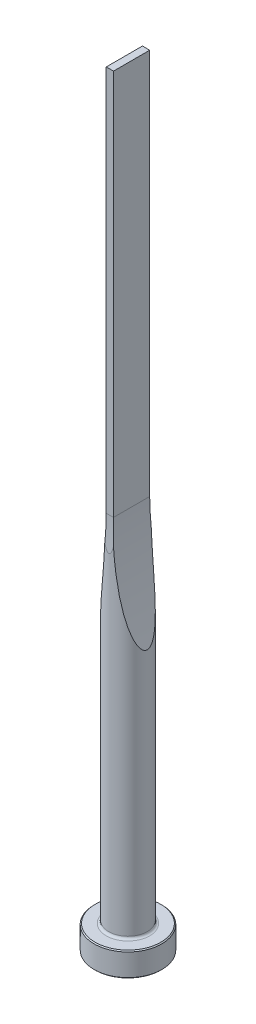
ISO-10303-21;
HEADER;
FILE_DESCRIPTION(('STEP AP214'),'2;1');
FILE_NAME('part.step','',(''),(''),'','','');
FILE_SCHEMA(('AUTOMOTIVE_DESIGN { 1 0 10303 214 1 1 1 1 }'));
ENDSEC;
DATA;
#1=APPLICATION_CONTEXT('core data for automotive mechanical design processes');
#2=APPLICATION_PROTOCOL_DEFINITION('international standard','automotive_design',2000,#1);
#3=PRODUCT_CONTEXT('',#1,'mechanical');
#4=PRODUCT('Part','Part','',(#3));
#5=PRODUCT_RELATED_PRODUCT_CATEGORY('part','',(#4));
#6=PRODUCT_DEFINITION_FORMATION('','',#4);
#7=PRODUCT_DEFINITION_CONTEXT('part definition',#1,'design');
#8=PRODUCT_DEFINITION('design','',#6,#7);
#9=PRODUCT_DEFINITION_SHAPE('','',#8);
#10=(LENGTH_UNIT() NAMED_UNIT(*) SI_UNIT(.MILLI.,.METRE.));
#11=(NAMED_UNIT(*) PLANE_ANGLE_UNIT() SI_UNIT($,.RADIAN.));
#12=(NAMED_UNIT(*) SI_UNIT($,.STERADIAN.) SOLID_ANGLE_UNIT());
#13=UNCERTAINTY_MEASURE_WITH_UNIT(LENGTH_MEASURE(1.E-05),#10,'distance_accuracy_value','');
#14=(GEOMETRIC_REPRESENTATION_CONTEXT(3) GLOBAL_UNCERTAINTY_ASSIGNED_CONTEXT((#13)) GLOBAL_UNIT_ASSIGNED_CONTEXT((#10,
#11,#12)) REPRESENTATION_CONTEXT('',''));
#15=CARTESIAN_POINT('',(0.,0.,0.));
#16=DIRECTION('',(0.,0.,1.));
#17=DIRECTION('',(1.,0.,0.));
#18=AXIS2_PLACEMENT_3D('',#15,#16,#17);
#19=CARTESIAN_POINT('',(0.,0.,0.));
#20=DIRECTION('',(0.,1.,0.));
#21=DIRECTION('',(-1.,0.,0.));
#22=AXIS2_PLACEMENT_3D('',#19,#20,#21);
#23=PLANE('',#22);
#24=CARTESIAN_POINT('',(0.,0.,0.));
#25=DIRECTION('',(0.,1.,0.));
#26=DIRECTION('',(-1.,0.,0.));
#27=AXIS2_PLACEMENT_3D('',#24,#25,#26);
#28=CIRCLE('',#27,6.8);
#29=CARTESIAN_POINT('',(-6.8,0.,0.));
#30=VERTEX_POINT('',#29);
#31=EDGE_CURVE('E133',#30,#30,#28,.T.);
#32=ORIENTED_EDGE('',*,*,#31,.F.);
#33=EDGE_LOOP('',(#32));
#34=FACE_BOUND('',#33,.T.);
#35=ADVANCED_FACE('F32',(#34),#23,.F.);
#36=CARTESIAN_POINT('',(0.,0.,0.));
#37=DIRECTION('',(0.,1.,0.));
#38=DIRECTION('',(-1.,0.,0.));
#39=AXIS2_PLACEMENT_3D('',#36,#37,#38);
#40=CONICAL_SURFACE('',#39,6.8,0.785398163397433);
#41=CARTESIAN_POINT('',(0.,0.200000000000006,0.));
#42=DIRECTION('',(0.,1.,0.));
#43=DIRECTION('',(-1.,0.,0.));
#44=AXIS2_PLACEMENT_3D('',#41,#42,#43);
#45=CIRCLE('',#44,7.);
#46=CARTESIAN_POINT('',(-7.,0.200000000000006,0.));
#47=VERTEX_POINT('',#46);
#48=EDGE_CURVE('E130',#47,#47,#45,.T.);
#49=ORIENTED_EDGE('',*,*,#48,.F.);
#50=EDGE_LOOP('',(#49));
#51=FACE_BOUND('',#50,.T.);
#52=ORIENTED_EDGE('',*,*,#31,.T.);
#53=EDGE_LOOP('',(#52));
#54=FACE_BOUND('',#53,.T.);
#55=ADVANCED_FACE('F171',(#51,#54),#40,.T.);
#56=CARTESIAN_POINT('',(0.,160.,0.));
#57=DIRECTION('',(0.,1.,0.));
#58=DIRECTION('',(-1.,0.,0.));
#59=AXIS2_PLACEMENT_3D('',#56,#57,#58);
#60=CYLINDRICAL_SURFACE('',#59,7.);
#61=CARTESIAN_POINT('',(0.,4.8,0.));
#62=DIRECTION('',(0.,1.,0.));
#63=DIRECTION('',(-1.,0.,0.));
#64=AXIS2_PLACEMENT_3D('',#61,#62,#63);
#65=CIRCLE('',#64,7.);
#66=CARTESIAN_POINT('',(-7.,4.8,0.));
#67=VERTEX_POINT('',#66);
#68=EDGE_CURVE('E127',#67,#67,#65,.T.);
#69=ORIENTED_EDGE('',*,*,#68,.F.);
#70=EDGE_LOOP('',(#69));
#71=FACE_BOUND('',#70,.T.);
#72=ORIENTED_EDGE('',*,*,#48,.T.);
#73=EDGE_LOOP('',(#72));
#74=FACE_BOUND('',#73,.T.);
#75=ADVANCED_FACE('F176',(#71,#74),#60,.T.);
#76=CARTESIAN_POINT('',(0.,4.8,0.));
#77=DIRECTION('',(0.,-1.,0.));
#78=DIRECTION('',(1.,0.,0.));
#79=AXIS2_PLACEMENT_3D('',#76,#77,#78);
#80=CONICAL_SURFACE('',#79,7.,0.785398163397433);
#81=CARTESIAN_POINT('',(0.,5.,0.));
#82=DIRECTION('',(0.,1.,0.));
#83=DIRECTION('',(-1.,0.,0.));
#84=AXIS2_PLACEMENT_3D('',#81,#82,#83);
#85=CIRCLE('',#84,6.8);
#86=CARTESIAN_POINT('',(-6.8,5.,0.));
#87=VERTEX_POINT('',#86);
#88=EDGE_CURVE('E124',#87,#87,#85,.T.);
#89=ORIENTED_EDGE('',*,*,#88,.F.);
#90=EDGE_LOOP('',(#89));
#91=FACE_BOUND('',#90,.T.);
#92=ORIENTED_EDGE('',*,*,#68,.T.);
#93=EDGE_LOOP('',(#92));
#94=FACE_BOUND('',#93,.T.);
#95=ADVANCED_FACE('F183',(#91,#94),#80,.T.);
#96=CARTESIAN_POINT('',(6.8,5.,0.));
#97=DIRECTION('',(0.,-1.,0.));
#98=DIRECTION('',(1.,0.,0.));
#99=AXIS2_PLACEMENT_3D('',#96,#97,#98);
#100=PLANE('',#99);
#101=CARTESIAN_POINT('',(0.,5.,0.));
#102=DIRECTION('',(0.,1.,0.));
#103=DIRECTION('',(-1.,0.,0.));
#104=AXIS2_PLACEMENT_3D('',#101,#102,#103);
#105=CIRCLE('',#104,4.50000000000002);
#106=CARTESIAN_POINT('',(-4.50000000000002,5.,0.));
#107=VERTEX_POINT('',#106);
#108=EDGE_CURVE('E121',#107,#107,#105,.T.);
#109=ORIENTED_EDGE('',*,*,#108,.F.);
#110=EDGE_LOOP('',(#109));
#111=FACE_BOUND('',#110,.T.);
#112=ORIENTED_EDGE('',*,*,#88,.T.);
#113=EDGE_LOOP('',(#112));
#114=FACE_BOUND('',#113,.T.);
#115=ADVANCED_FACE('F190',(#111,#114),#100,.F.);
#116=CARTESIAN_POINT('',(0.,5.5,0.));
#117=DIRECTION('',(0.,1.,0.));
#118=DIRECTION('',(-1.,0.,0.));
#119=AXIS2_PLACEMENT_3D('',#116,#117,#118);
#120=TOROIDAL_SURFACE('',#119,4.50000000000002,0.5);
#121=CARTESIAN_POINT('',(0.,5.50000000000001,0.));
#122=DIRECTION('',(0.,1.,0.));
#123=DIRECTION('',(-1.,0.,0.));
#124=AXIS2_PLACEMENT_3D('',#121,#122,#123);
#125=CIRCLE('',#124,4.00000000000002);
#126=CARTESIAN_POINT('',(-4.00000000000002,5.50000000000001,0.));
#127=VERTEX_POINT('',#126);
#128=EDGE_CURVE('E112',#127,#127,#125,.T.);
#129=ORIENTED_EDGE('',*,*,#128,.F.);
#130=EDGE_LOOP('',(#129));
#131=FACE_BOUND('',#130,.T.);
#132=ORIENTED_EDGE('',*,*,#108,.T.);
#133=EDGE_LOOP('',(#132));
#134=FACE_BOUND('',#133,.T.);
#135=ADVANCED_FACE('F168',(#131,#134),#120,.F.);
#136=CARTESIAN_POINT('',(0.,160.,0.));
#137=DIRECTION('',(0.,1.,0.));
#138=DIRECTION('',(-1.,0.,0.));
#139=AXIS2_PLACEMENT_3D('',#136,#137,#138);
#140=CYLINDRICAL_SURFACE('',#139,4.00000000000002);
#141=CARTESIAN_POINT('',(4.00000000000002,56.0325741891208,0.));
#142=CARTESIAN_POINT('',(3.99999950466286,56.0325759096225,0.0713264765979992));
#143=CARTESIAN_POINT('',(3.99806618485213,56.0395703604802,0.142658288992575));
#144=CARTESIAN_POINT('',(3.99062001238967,56.0665471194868,0.282656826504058));
#145=CARTESIAN_POINT('',(3.9851006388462,56.086553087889,0.351318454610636));
#146=CARTESIAN_POINT('',(3.96961077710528,56.1428195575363,0.498851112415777));
#147=CARTESIAN_POINT('',(3.95892640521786,56.1816943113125,0.576627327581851));
#148=CARTESIAN_POINT('',(3.93451287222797,56.2708338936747,0.724762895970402));
#149=CARTESIAN_POINT('',(3.92077776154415,56.3211209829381,0.795107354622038));
#150=CARTESIAN_POINT('',(3.89322114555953,56.4224183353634,0.91997423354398));
#151=CARTESIAN_POINT('',(3.87965036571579,56.4724569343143,0.975359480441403));
#152=CARTESIAN_POINT('',(3.85141059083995,56.5769751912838,1.08150621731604));
#153=CARTESIAN_POINT('',(3.83674071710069,56.6314584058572,1.13226393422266));
#154=CARTESIAN_POINT('',(3.80659761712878,56.7438572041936,1.2298070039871));
#155=CARTESIAN_POINT('',(3.79112262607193,56.8017803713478,1.27658298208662));
#156=CARTESIAN_POINT('',(3.75962960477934,56.9201557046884,1.36654788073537));
#157=CARTESIAN_POINT('',(3.74361174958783,56.9806070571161,1.40973794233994));
#158=CARTESIAN_POINT('',(3.70353204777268,57.132530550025,1.51267555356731));
#159=CARTESIAN_POINT('',(3.67924394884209,57.2251695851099,1.57060937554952));
#160=CARTESIAN_POINT('',(3.63017448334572,57.4135992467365,1.68091368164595));
#161=CARTESIAN_POINT('',(3.60539287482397,57.5093914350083,1.73328135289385));
#162=CARTESIAN_POINT('',(3.5555303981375,57.7034862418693,1.83339467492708));
#163=CARTESIAN_POINT('',(3.53044909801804,57.801792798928,1.88113243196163));
#164=CARTESIAN_POINT('',(3.48018126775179,58.000244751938,1.97257511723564));
#165=CARTESIAN_POINT('',(3.45499471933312,58.1003904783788,2.01627931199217));
#166=CARTESIAN_POINT('',(3.37922094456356,58.4039233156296,2.14256490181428));
#167=CARTESIAN_POINT('',(3.32864824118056,58.6095172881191,2.21987537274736));
#168=CARTESIAN_POINT('',(3.25330139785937,58.9206464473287,2.32764275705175));
#169=CARTESIAN_POINT('',(3.22828383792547,59.0247584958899,2.36218323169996));
#170=CARTESIAN_POINT('',(3.17844715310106,59.2338094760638,2.42882897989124));
#171=CARTESIAN_POINT('',(3.15362802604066,59.3387483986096,2.46093428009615));
#172=CARTESIAN_POINT('',(3.08281766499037,59.6405823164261,2.54984754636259));
#173=CARTESIAN_POINT('',(3.03712088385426,59.8383448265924,2.60394744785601));
#174=CARTESIAN_POINT('',(2.94672418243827,60.2357317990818,2.70581697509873));
#175=CARTESIAN_POINT('',(2.90202440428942,60.4353565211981,2.75358570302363));
#176=CARTESIAN_POINT('',(2.81372139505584,60.8361529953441,2.84375741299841));
#177=CARTESIAN_POINT('',(2.77011869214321,61.0373254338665,2.88615784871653));
#178=CARTESIAN_POINT('',(2.68411186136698,61.4408534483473,2.96630907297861));
#179=CARTESIAN_POINT('',(2.64170779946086,61.643209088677,3.00405960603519));
#180=CARTESIAN_POINT('',(2.51619962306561,62.252641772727,3.11142040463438));
#181=CARTESIAN_POINT('',(2.43499719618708,62.661188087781,3.17494436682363));
#182=CARTESIAN_POINT('',(2.27800364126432,63.4809187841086,3.28939033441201));
#183=CARTESIAN_POINT('',(2.20221118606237,63.8921024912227,3.34031543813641));
#184=CARTESIAN_POINT('',(2.05591392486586,64.7181254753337,3.43230374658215));
#185=CARTESIAN_POINT('',(1.98543028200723,65.1329727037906,3.47332878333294));
#186=CARTESIAN_POINT('',(1.85018337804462,65.9643314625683,3.54721733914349));
#187=CARTESIAN_POINT('',(1.78542039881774,66.3808430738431,3.58008045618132));
#188=CARTESIAN_POINT('',(1.66177903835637,67.2146078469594,3.63911728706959));
#189=CARTESIAN_POINT('',(1.60289256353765,67.6318591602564,3.66530028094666));
#190=CARTESIAN_POINT('',(1.49095087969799,68.4674441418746,3.71224217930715));
#191=CARTESIAN_POINT('',(1.43789571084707,68.8857778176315,3.73300104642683));
#192=CARTESIAN_POINT('',(1.31657079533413,69.899470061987,3.77788653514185));
#193=CARTESIAN_POINT('',(1.25128627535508,70.4952874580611,3.79975788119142));
#194=CARTESIAN_POINT('',(1.1326156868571,71.6883317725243,3.8367996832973));
#195=CARTESIAN_POINT('',(1.07923021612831,72.2855587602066,3.85196980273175));
#196=CARTESIAN_POINT('',(0.984389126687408,73.4811950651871,3.87729117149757));
#197=CARTESIAN_POINT('',(0.942936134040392,74.0796046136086,3.88744131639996));
#198=CARTESIAN_POINT('',(0.872000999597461,75.2771730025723,3.90396441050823));
#199=CARTESIAN_POINT('',(0.842518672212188,75.8763318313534,3.91033741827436));
#200=CARTESIAN_POINT('',(0.79548061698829,77.0766331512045,3.92017714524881));
#201=CARTESIAN_POINT('',(0.777954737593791,77.677776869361,3.92363659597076));
#202=CARTESIAN_POINT('',(0.754956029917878,78.8803060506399,3.92812655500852));
#203=CARTESIAN_POINT('',(0.749483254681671,79.4816915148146,3.92915705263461));
#204=CARTESIAN_POINT('',(0.750593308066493,80.684328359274,3.92894515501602));
#205=CARTESIAN_POINT('',(0.757173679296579,81.2855797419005,3.92770322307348));
#206=CARTESIAN_POINT('',(0.782382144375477,82.4878181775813,3.92275968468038));
#207=CARTESIAN_POINT('',(0.801010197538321,83.0888052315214,3.91905808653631));
#208=CARTESIAN_POINT('',(0.850127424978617,84.28593004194,3.90869667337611));
#209=CARTESIAN_POINT('',(0.880530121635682,84.8820715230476,3.90205837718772));
#210=CARTESIAN_POINT('',(0.953185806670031,86.0735830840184,3.88494912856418));
#211=CARTESIAN_POINT('',(0.995438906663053,86.6689531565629,3.87447814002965));
#212=CARTESIAN_POINT('',(1.09179877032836,87.8589756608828,3.84843833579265));
#213=CARTESIAN_POINT('',(1.14591231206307,88.4536274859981,3.83286660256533));
#214=CARTESIAN_POINT('',(1.23592890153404,89.3445261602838,3.80440010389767));
#215=CARTESIAN_POINT('',(1.26740822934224,89.6413077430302,3.7940599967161));
#216=CARTESIAN_POINT('',(1.33331010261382,90.2344820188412,3.77140523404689));
#217=CARTESIAN_POINT('',(1.3677327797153,90.5308746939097,3.75909049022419));
#218=CARTESIAN_POINT('',(1.4751428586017,91.4172371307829,3.7188460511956));
#219=CARTESIAN_POINT('',(1.55248924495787,92.0065371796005,3.68755167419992));
#220=CARTESIAN_POINT('',(1.71872615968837,93.1827530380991,3.61307499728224));
#221=CARTESIAN_POINT('',(1.80761605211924,93.7696689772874,3.56989335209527));
#222=CARTESIAN_POINT('',(1.94941894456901,94.6473394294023,3.49322496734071));
#223=CARTESIAN_POINT('',(1.99807318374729,94.9393097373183,3.46570183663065));
#224=CARTESIAN_POINT('',(2.09817634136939,95.5222942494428,3.40603301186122));
#225=CARTESIAN_POINT('',(2.14962517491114,95.8133084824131,3.37388745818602));
#226=CARTESIAN_POINT('',(2.25525458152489,96.3941190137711,3.30421364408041));
#227=CARTESIAN_POINT('',(2.3094344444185,96.6839156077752,3.26668677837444));
#228=CARTESIAN_POINT('',(2.42046542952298,97.2620959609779,3.18529331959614));
#229=CARTESIAN_POINT('',(2.4773163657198,97.5504798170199,3.14142716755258));
#230=CARTESIAN_POINT('',(2.56104974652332,97.9645690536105,3.07280240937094));
#231=CARTESIAN_POINT('',(2.58689760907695,98.0909919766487,3.05108974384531));
#232=CARTESIAN_POINT('',(2.63907980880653,98.3434554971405,3.00606800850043));
#233=CARTESIAN_POINT('',(2.66541415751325,98.4694960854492,2.98275890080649));
#234=CARTESIAN_POINT('',(2.74513713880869,98.8470228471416,2.9102234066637));
#235=CARTESIAN_POINT('',(2.79923659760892,99.0978689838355,2.85839621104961));
#236=CARTESIAN_POINT('',(2.90922667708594,99.5975521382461,2.7463738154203));
#237=CARTESIAN_POINT('',(2.96511888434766,99.8463871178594,2.68617103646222));
#238=CARTESIAN_POINT('',(3.07840839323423,100.341001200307,2.55556322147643));
#239=CARTESIAN_POINT('',(3.1358053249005,100.586781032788,2.48516067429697));
#240=CARTESIAN_POINT('',(3.23160425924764,100.989453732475,2.35810611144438));
#241=CARTESIAN_POINT('',(3.26968503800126,101.14759095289,2.30516204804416));
#242=CARTESIAN_POINT('',(3.34616597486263,101.46149766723,2.19267247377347));
#243=CARTESIAN_POINT('',(3.38456621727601,101.617266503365,2.13312516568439));
#244=CARTESIAN_POINT('',(3.46130470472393,101.925071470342,2.00620465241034));
#245=CARTESIAN_POINT('',(3.49964280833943,102.077117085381,1.93885455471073));
#246=CARTESIAN_POINT('',(3.57593895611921,102.376480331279,1.79425978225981));
#247=CARTESIAN_POINT('',(3.61389726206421,102.523801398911,1.71702251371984));
#248=CARTESIAN_POINT('',(3.67790204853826,102.769737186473,1.57393162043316));
#249=CARTESIAN_POINT('',(3.70421811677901,102.870114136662,1.51124772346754));
#250=CARTESIAN_POINT('',(3.75590473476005,103.065941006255,1.37779486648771));
#251=CARTESIAN_POINT('',(3.78127371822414,103.161382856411,1.30701323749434));
#252=CARTESIAN_POINT('',(3.83051134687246,103.345484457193,1.15484156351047));
#253=CARTESIAN_POINT('',(3.85436429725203,103.434074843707,1.07336112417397));
#254=CARTESIAN_POINT('',(3.89897031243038,103.598852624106,0.897882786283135));
#255=CARTESIAN_POINT('',(3.91973289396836,103.675078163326,0.803925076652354));
#256=CARTESIAN_POINT('',(3.94808248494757,103.778744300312,0.645027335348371));
#257=CARTESIAN_POINT('',(3.95749846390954,103.813077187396,0.584955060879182));
#258=CARTESIAN_POINT('',(3.97393505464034,103.872903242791,0.460206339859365));
#259=CARTESIAN_POINT('',(3.98095779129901,103.898404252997,0.395534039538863));
#260=CARTESIAN_POINT('',(3.99199698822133,103.938449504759,0.26172716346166));
#261=CARTESIAN_POINT('',(3.9959785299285,103.952866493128,0.192550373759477));
#262=CARTESIAN_POINT('',(4.00026396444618,103.968382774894,0.0526148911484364));
#263=CARTESIAN_POINT('',(4.00057164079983,103.969495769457,-0.0181420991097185));
#264=CARTESIAN_POINT('',(3.99766674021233,103.958979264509,-0.149935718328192));
#265=CARTESIAN_POINT('',(3.99487575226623,103.94887582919,-0.211112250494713));
#266=CARTESIAN_POINT('',(3.98673565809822,103.919368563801,-0.330994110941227));
#267=CARTESIAN_POINT('',(3.98138439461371,103.89995689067,-0.389697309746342));
#268=CARTESIAN_POINT('',(3.96583404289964,103.843441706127,-0.52808540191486));
#269=CARTESIAN_POINT('',(3.95454028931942,103.802321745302,-0.605990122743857));
#270=CARTESIAN_POINT('',(3.92897552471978,103.708902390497,-0.754222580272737));
#271=CARTESIAN_POINT('',(3.91469691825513,103.656574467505,-0.824530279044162));
#272=CARTESIAN_POINT('',(3.88580277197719,103.550243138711,-0.950930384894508));
#273=CARTESIAN_POINT('',(3.87138709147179,103.497019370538,-1.00773879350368));
#274=CARTESIAN_POINT('',(3.84144542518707,103.386031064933,-1.11645860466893));
#275=CARTESIAN_POINT('',(3.82591849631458,103.328262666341,-1.16836575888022));
#276=CARTESIAN_POINT('',(3.79406184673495,103.209235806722,-1.2680044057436));
#277=CARTESIAN_POINT('',(3.77773035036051,103.147969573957,-1.31572595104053));
#278=CARTESIAN_POINT('',(3.74453529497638,103.02288648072,-1.40741921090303));
#279=CARTESIAN_POINT('',(3.72767192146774,102.959070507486,-1.45139221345));
#280=CARTESIAN_POINT('',(3.6850659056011,102.797090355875,-1.55723608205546));
#281=CARTESIAN_POINT('',(3.65909052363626,102.697673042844,-1.61709186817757));
#282=CARTESIAN_POINT('',(3.60667166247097,102.49558279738,-1.73084777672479));
#283=CARTESIAN_POINT('',(3.58022794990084,102.392908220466,-1.78474482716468));
#284=CARTESIAN_POINT('',(3.52707575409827,102.184972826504,-1.88761600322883));
#285=CARTESIAN_POINT('',(3.50036689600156,102.079707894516,-1.93658156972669));
#286=CARTESIAN_POINT('',(3.44688886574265,101.867299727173,-2.03023546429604));
#287=CARTESIAN_POINT('',(3.4201196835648,101.760156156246,-2.07492301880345));
#288=CARTESIAN_POINT('',(3.33966353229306,101.43555120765,-2.20385980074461));
#289=CARTESIAN_POINT('',(3.28606580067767,101.215844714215,-2.28253851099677));
#290=CARTESIAN_POINT('',(3.20634562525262,100.88352420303,-2.39193438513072));
#291=CARTESIAN_POINT('',(3.17989871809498,100.772349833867,-2.42694647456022));
#292=CARTESIAN_POINT('',(3.12725781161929,100.549165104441,-2.49441273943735));
#293=CARTESIAN_POINT('',(3.10106380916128,100.437154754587,-2.52686694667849));
#294=CARTESIAN_POINT('',(3.02555443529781,100.111429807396,-2.6176349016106));
#295=CARTESIAN_POINT('',(2.97661970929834,99.8967964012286,-2.67297127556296));
#296=CARTESIAN_POINT('',(2.87998545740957,99.4655949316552,-2.77681550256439));
#297=CARTESIAN_POINT('',(2.83228610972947,99.24902659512,-2.82532237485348));
#298=CARTESIAN_POINT('',(2.7382269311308,98.8142840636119,-2.91657491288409));
#299=CARTESIAN_POINT('',(2.69186774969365,98.5961091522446,-2.95931782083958));
#300=CARTESIAN_POINT('',(2.600595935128,98.1585387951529,-3.03983446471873));
#301=CARTESIAN_POINT('',(2.55568338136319,97.9391432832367,-3.07760792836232));
#302=CARTESIAN_POINT('',(2.42301117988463,97.2784574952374,-3.18465295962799));
#303=CARTESIAN_POINT('',(2.33753064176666,96.8356546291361,-3.24744892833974));
#304=CARTESIAN_POINT('',(2.17299340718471,95.9473501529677,-3.35975720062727));
#305=CARTESIAN_POINT('',(2.09393511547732,95.5018492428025,-3.40927281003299));
#306=CARTESIAN_POINT('',(1.94209008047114,94.6069144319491,-3.4980060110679));
#307=CARTESIAN_POINT('',(1.86932977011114,94.157471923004,-3.53718149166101));
#308=CARTESIAN_POINT('',(1.73054916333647,93.256884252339,-3.60710795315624));
#309=CARTESIAN_POINT('',(1.66452920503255,92.805739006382,-3.63785851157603));
#310=CARTESIAN_POINT('',(1.53939600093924,91.9027557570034,-3.69254825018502));
#311=CARTESIAN_POINT('',(1.48027287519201,91.4509197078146,-3.71649724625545));
#312=CARTESIAN_POINT('',(1.36886981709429,90.5461524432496,-3.75895497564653));
#313=CARTESIAN_POINT('',(1.31658993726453,90.0932212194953,-3.77746366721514));
#314=CARTESIAN_POINT('',(1.20425797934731,89.0504935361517,-3.81500437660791));
#315=CARTESIAN_POINT('',(1.14657684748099,88.4603865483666,-3.83252876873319));
#316=CARTESIAN_POINT('',(1.04287719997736,87.2789943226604,-3.86203366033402));
#317=CARTESIAN_POINT('',(0.996859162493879,86.6877090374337,-3.874013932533));
#318=CARTESIAN_POINT('',(0.916509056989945,85.5041606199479,-3.89380571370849));
#319=CARTESIAN_POINT('',(0.882179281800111,84.9118973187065,-3.90161640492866));
#320=CARTESIAN_POINT('',(0.825236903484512,83.7267834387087,-3.91405566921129));
#321=CARTESIAN_POINT('',(0.802624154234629,83.1339328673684,-3.91868428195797));
#322=CARTESIAN_POINT('',(0.769080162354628,81.9462654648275,-3.92540556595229));
#323=CARTESIAN_POINT('',(0.758181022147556,81.3514476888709,-3.92749127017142));
#324=CARTESIAN_POINT('',(0.748179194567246,80.1617071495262,-3.92940881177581));
#325=CARTESIAN_POINT('',(0.749076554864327,79.5667843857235,-3.92924064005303));
#326=CARTESIAN_POINT('',(0.762665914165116,78.3772119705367,-3.92662562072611));
#327=CARTESIAN_POINT('',(0.775355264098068,77.7825622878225,-3.92417928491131));
#328=CARTESIAN_POINT('',(0.812518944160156,76.5936495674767,-3.916653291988));
#329=CARTESIAN_POINT('',(0.836993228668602,75.9993865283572,-3.91157364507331));
#330=CARTESIAN_POINT('',(0.89747150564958,74.8162597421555,-3.89814031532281));
#331=CARTESIAN_POINT('',(0.933381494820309,74.2273909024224,-3.88981320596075));
#332=CARTESIAN_POINT('',(1.01676754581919,73.0505408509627,-3.86885412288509));
#333=CARTESIAN_POINT('',(1.06424375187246,72.4625596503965,-3.85622209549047));
#334=CARTESIAN_POINT('',(1.17077166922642,71.28735407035,-3.82522998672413));
#335=CARTESIAN_POINT('',(1.22983178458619,70.7001305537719,-3.80686574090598));
#336=CARTESIAN_POINT('',(1.32704657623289,69.8204897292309,-3.77360700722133));
#337=CARTESIAN_POINT('',(1.36088808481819,69.5274817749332,-3.7615690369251));
#338=CARTESIAN_POINT('',(1.43143932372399,68.9418945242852,-3.73529081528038));
#339=CARTESIAN_POINT('',(1.46814920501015,68.6493152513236,-3.7210504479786));
#340=CARTESIAN_POINT('',(1.58224013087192,67.7748100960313,-3.67467962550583));
#341=CARTESIAN_POINT('',(1.66385826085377,67.1936227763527,-3.6388104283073));
#342=CARTESIAN_POINT('',(1.83829242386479,66.0338980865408,-3.55389007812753));
#343=CARTESIAN_POINT('',(1.93110766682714,65.4553605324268,-3.5048398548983));
#344=CARTESIAN_POINT('',(2.0784890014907,64.5906346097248,-3.41805425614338));
#345=CARTESIAN_POINT('',(2.12894389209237,64.3030737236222,-3.38694611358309));
#346=CARTESIAN_POINT('',(2.2325381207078,63.7290448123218,-3.31957866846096));
#347=CARTESIAN_POINT('',(2.28567735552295,63.4425767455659,-3.28331956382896));
#348=CARTESIAN_POINT('',(2.39455841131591,62.871061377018,-3.20477670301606));
#349=CARTESIAN_POINT('',(2.45029935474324,62.5860136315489,-3.16249496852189));
#350=CARTESIAN_POINT('',(2.56430489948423,62.0175869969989,-3.070782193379));
#351=CARTESIAN_POINT('',(2.62256925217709,61.7342079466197,-3.0213518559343));
#352=CARTESIAN_POINT('',(2.69917087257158,61.3704960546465,-2.95211901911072));
#353=CARTESIAN_POINT('',(2.71641615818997,61.2891738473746,-2.93626409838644));
#354=CARTESIAN_POINT('',(2.7511009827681,61.1267207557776,-2.90379209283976));
#355=CARTESIAN_POINT('',(2.7685405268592,61.0455898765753,-2.88717498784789));
#356=CARTESIAN_POINT('',(2.82114708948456,60.8024918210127,-2.83611007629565));
#357=CARTESIAN_POINT('',(2.8565981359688,60.6408377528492,-2.80045217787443));
#358=CARTESIAN_POINT('',(2.9281701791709,60.318704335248,-2.72552787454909));
#359=CARTESIAN_POINT('',(2.96429041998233,60.1582239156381,-2.68626536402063));
#360=CARTESIAN_POINT('',(3.03717038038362,59.8384919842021,-2.60358040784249));
#361=CARTESIAN_POINT('',(3.07393006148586,59.6792403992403,-2.56015821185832));
#362=CARTESIAN_POINT('',(3.16303611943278,59.2979205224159,-2.44991535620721));
#363=CARTESIAN_POINT('',(3.21565434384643,59.0765852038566,-2.38074999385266));
#364=CARTESIAN_POINT('',(3.32174559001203,58.6376183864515,-2.23036726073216));
#365=CARTESIAN_POINT('',(3.37522016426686,58.419995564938,-2.1491250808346));
#366=CARTESIAN_POINT('',(3.45810613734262,58.0879022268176,-2.01115077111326));
#367=CARTESIAN_POINT('',(3.48749732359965,57.97115900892,-1.95988112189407));
#368=CARTESIAN_POINT('',(3.5461089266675,57.7402707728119,-1.85173049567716));
#369=CARTESIAN_POINT('',(3.5753293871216,57.6261250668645,-1.79485102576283));
#370=CARTESIAN_POINT('',(3.63324368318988,57.4016779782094,-1.67451120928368));
#371=CARTESIAN_POINT('',(3.66193889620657,57.2913655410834,-1.61107232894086));
#372=CARTESIAN_POINT('',(3.71845516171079,57.0757206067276,-1.47596241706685));
#373=CARTESIAN_POINT('',(3.74627701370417,56.9703835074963,-1.4042992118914));
#374=CARTESIAN_POINT('',(3.79443757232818,56.7892927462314,-1.26739412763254));
#375=CARTESIAN_POINT('',(3.81508240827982,56.7121064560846,-1.20417406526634));
#376=CARTESIAN_POINT('',(3.85488954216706,56.5640094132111,-1.06992582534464));
#377=CARTESIAN_POINT('',(3.87404890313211,56.4931110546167,-0.998882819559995));
#378=CARTESIAN_POINT('',(3.91018363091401,56.3599682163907,-0.846577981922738));
#379=CARTESIAN_POINT('',(3.92712474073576,56.2978584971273,-0.76518723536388));
#380=CARTESIAN_POINT('',(3.95691060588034,56.1890189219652,-0.59201112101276));
#381=CARTESIAN_POINT('',(3.96977266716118,56.1422240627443,-0.500271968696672));
#382=CARTESIAN_POINT('',(3.98608657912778,56.0829777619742,-0.33956730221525));
#383=CARTESIAN_POINT('',(3.99124385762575,56.0642861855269,-0.273107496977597));
#384=CARTESIAN_POINT('',(3.99819820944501,56.0390929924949,-0.137764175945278));
#385=CARTESIAN_POINT('',(4.00000047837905,56.0325725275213,-0.0688845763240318));
#386=CARTESIAN_POINT('',(4.00000000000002,56.0325741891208,0.));
#387=B_SPLINE_CURVE_WITH_KNOTS('',3,(#141,#142,#143,#144,#145,#146,#147,#148,#149,#150,#151,
#152,#153,#154,#155,#156,#157,#158,#159,#160,#161,#162,#163,#164,#165,#166,#167,#168,#169,#170,
#171,#172,#173,#174,#175,#176,#177,#178,#179,#180,#181,#182,#183,#184,#185,#186,#187,#188,#189,
#190,#191,#192,#193,#194,#195,#196,#197,#198,#199,#200,#201,#202,#203,#204,#205,#206,#207,#208,
#209,#210,#211,#212,#213,#214,#215,#216,#217,#218,#219,#220,#221,#222,#223,#224,#225,#226,#227,
#228,#229,#230,#231,#232,#233,#234,#235,#236,#237,#238,#239,#240,#241,#242,#243,#244,#245,#246,
#247,#248,#249,#250,#251,#252,#253,#254,#255,#256,#257,#258,#259,#260,#261,#262,#263,#264,#265,
#266,#267,#268,#269,#270,#271,#272,#273,#274,#275,#276,#277,#278,#279,#280,#281,#282,#283,#284,
#285,#286,#287,#288,#289,#290,#291,#292,#293,#294,#295,#296,#297,#298,#299,#300,#301,#302,#303,
#304,#305,#306,#307,#308,#309,#310,#311,#312,#313,#314,#315,#316,#317,#318,#319,#320,#321,#322,
#323,#324,#325,#326,#327,#328,#329,#330,#331,#332,#333,#334,#335,#336,#337,#338,#339,#340,#341,
#342,#343,#344,#345,#346,#347,#348,#349,#350,#351,#352,#353,#354,#355,#356,#357,#358,#359,#360,
#361,#362,#363,#364,#365,#366,#367,#368,#369,#370,#371,#372,#373,#374,#375,#376,#377,#378,#379,
#380,#381,#382,#383,#384,#385,#386),.UNSPECIFIED.,.T.,.F.,(4,2,2,2,2,2,2,2,2,2,2,2,2,2,2,2,2,2,
2,2,2,2,2,2,2,2,2,2,2,2,2,2,2,2,2,2,2,2,2,2,2,2,2,2,2,2,2,2,2,2,2,2,2,2,2,2,2,2,2,2,2,2,2,2,2,2,
2,2,2,2,2,2,2,2,2,2,2,2,2,2,2,2,2,2,2,2,2,2,2,2,2,2,2,2,2,2,2,2,2,2,2,2,2,2,2,2,2,2,2,2,2,2,2,2,
2,2,2,2,2,2,2,2,4),(0.,0.213652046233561,0.42769368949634,0.68901290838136,0.950846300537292,
1.17811762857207,1.40557263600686,1.63354915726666,1.86145285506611,2.19699113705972,
2.532698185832,2.86896788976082,3.20529862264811,3.88101167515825,4.21852255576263,
4.5560297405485,5.18606925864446,5.81619802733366,6.44662457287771,7.07708574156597,
8.34082153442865,9.60424623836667,10.872466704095,12.1407496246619,13.4072609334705,
14.6737809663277,16.4729471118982,18.2722036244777,20.0718558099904,21.8714800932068,
23.6755807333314,25.4796893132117,27.2834301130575,29.0871648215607,30.8778960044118,
32.668644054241,34.4604181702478,35.3562762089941,36.2521743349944,38.0374990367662,
39.8227254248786,40.7145047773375,41.6062570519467,42.4977786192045,43.3892381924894,
43.7817851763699,44.174341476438,44.9595936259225,45.7455610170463,46.5313369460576,
47.0443974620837,47.5575979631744,48.0693157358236,48.5806524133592,48.9440796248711,
49.3080834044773,49.6753886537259,50.0415382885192,50.2504376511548,50.4591510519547,
50.6702262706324,50.8810840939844,51.0664193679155,51.2519110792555,51.5168366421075,
51.7824447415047,52.0196068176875,52.2569726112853,52.4948880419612,52.7327213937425,
53.0892042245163,53.4458699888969,53.8031444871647,54.1604834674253,54.8783259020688,
55.2368697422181,55.5954091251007,56.2762266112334,56.9571417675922,57.6383815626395,
58.3196586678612,59.6852978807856,61.0505968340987,62.4213731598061,63.7922182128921,
65.1610747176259,66.5299417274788,68.3093189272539,70.0887690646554,71.8685680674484,
73.6483448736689,75.4329870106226,77.2176363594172,79.0018848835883,80.786126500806,
82.5560643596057,84.3260242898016,86.0972730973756,86.9828576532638,87.8684888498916,
89.6322208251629,91.3958284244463,92.2766000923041,93.157337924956,94.0377808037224,
94.9181371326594,95.1720214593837,95.4259125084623,95.933752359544,96.4410498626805,
96.9483169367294,97.6614288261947,98.3760264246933,98.7684610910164,99.1607906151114,
99.5518745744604,99.9425894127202,100.247877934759,100.553755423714,100.86390685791,
101.172724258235,101.379382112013,101.585719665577),.UNSPECIFIED.);
#388=CARTESIAN_POINT('',(0.897915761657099,74.8421944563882,-3.89791576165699));
#389=VERTEX_POINT('',#388);
#390=CARTESIAN_POINT('',(0.897915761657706,74.8421944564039,3.89791576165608));
#391=VERTEX_POINT('',#390);
#392=EDGE_CURVE('E138',#389,#391,#387,.T.);
#393=ORIENTED_EDGE('',*,*,#392,.T.);
#394=CARTESIAN_POINT('',(-1.3919410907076,80.,3.74999999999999));
#395=CARTESIAN_POINT('',(-1.39194449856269,80.3340996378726,3.75000007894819));
#396=CARTESIAN_POINT('',(-1.38695792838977,80.668209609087,3.75186098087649));
#397=CARTESIAN_POINT('',(-1.36667392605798,81.3360771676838,3.75929815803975));
#398=CARTESIAN_POINT('',(-1.35137656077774,81.6698347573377,3.76487440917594));
#399=CARTESIAN_POINT('',(-1.30923320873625,82.337406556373,3.77973662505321));
#400=CARTESIAN_POINT('',(-1.28235776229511,82.6712187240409,3.78903204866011));
#401=CARTESIAN_POINT('',(-1.21470251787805,83.3371930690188,3.81127649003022));
#402=CARTESIAN_POINT('',(-1.17393087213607,83.6693560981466,3.82422336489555));
#403=CARTESIAN_POINT('',(-1.09844611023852,84.1657630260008,3.84630718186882));
#404=CARTESIAN_POINT('',(-1.07085040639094,84.3311442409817,3.85412453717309));
#405=CARTESIAN_POINT('',(-1.00961852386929,84.6608992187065,3.87061811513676));
#406=CARTESIAN_POINT('',(-0.975977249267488,84.8252720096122,3.87929505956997));
#407=CARTESIAN_POINT('',(-0.900897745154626,85.1517938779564,3.8974227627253));
#408=CARTESIAN_POINT('',(-0.85948063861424,85.3139477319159,3.90687138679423));
#409=CARTESIAN_POINT('',(-0.788768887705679,85.5545158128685,3.92153114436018));
#410=CARTESIAN_POINT('',(-0.76378693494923,85.6342087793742,3.92649537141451));
#411=CARTESIAN_POINT('',(-0.710141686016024,85.7923268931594,3.93655330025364));
#412=CARTESIAN_POINT('',(-0.68147996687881,85.8707525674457,3.94164694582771));
#413=CARTESIAN_POINT('',(-0.619110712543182,86.0259141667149,3.95192410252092));
#414=CARTESIAN_POINT('',(-0.585384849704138,86.1026427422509,3.95710787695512));
#415=CARTESIAN_POINT('',(-0.510918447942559,86.2524891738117,3.9674185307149));
#416=CARTESIAN_POINT('',(-0.470205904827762,86.3256199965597,3.97254555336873));
#417=CARTESIAN_POINT('',(-0.405871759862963,86.4217687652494,3.97939443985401));
#418=CARTESIAN_POINT('',(-0.387100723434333,86.4479908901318,3.98127456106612));
#419=CARTESIAN_POINT('',(-0.347340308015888,86.4988380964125,3.98494137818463));
#420=CARTESIAN_POINT('',(-0.326345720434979,86.5234591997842,3.98672783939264));
#421=CARTESIAN_POINT('',(-0.281381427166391,86.5704548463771,3.99015550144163));
#422=CARTESIAN_POINT('',(-0.257378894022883,86.5927987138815,3.99179469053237));
#423=CARTESIAN_POINT('',(-0.206002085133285,86.6332343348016,3.99477391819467));
#424=CARTESIAN_POINT('',(-0.178643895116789,86.6513452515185,3.99611530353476));
#425=CARTESIAN_POINT('',(-0.133196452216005,86.6742305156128,3.99781497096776));
#426=CARTESIAN_POINT('',(-0.116315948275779,86.6813683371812,3.99834625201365));
#427=CARTESIAN_POINT('',(-0.0816311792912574,86.6928863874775,3.99920443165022));
#428=CARTESIAN_POINT('',(-0.06382815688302,86.6972702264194,3.99953159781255));
#429=CARTESIAN_POINT('',(-0.0275781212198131,86.702824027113,3.99994619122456));
#430=CARTESIAN_POINT('',(-0.00912739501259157,86.7039706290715,4.00003187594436));
#431=CARTESIAN_POINT('',(0.0276703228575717,86.7028293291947,3.99994663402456));
#432=CARTESIAN_POINT('',(0.0460172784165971,86.700540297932,3.99977562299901));
#433=CARTESIAN_POINT('',(0.0805943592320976,86.6931273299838,3.99922251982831));
#434=CARTESIAN_POINT('',(0.0968774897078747,86.6882404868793,3.99885808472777));
#435=CARTESIAN_POINT('',(0.128581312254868,86.6762358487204,3.99796430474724));
#436=CARTESIAN_POINT('',(0.144001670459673,86.6691171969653,3.99743489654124));
#437=CARTESIAN_POINT('',(0.185006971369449,86.6471511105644,3.99580470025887));
#438=CARTESIAN_POINT('',(0.209611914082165,86.6304953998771,3.99457196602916));
#439=CARTESIAN_POINT('',(0.256071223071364,86.5937200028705,3.99186273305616));
#440=CARTESIAN_POINT('',(0.277915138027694,86.5735877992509,3.99038535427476));
#441=CARTESIAN_POINT('',(0.35066512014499,86.4990858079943,3.98494736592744));
#442=CARTESIAN_POINT('',(0.395552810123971,86.4389897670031,3.98061079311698));
#443=CARTESIAN_POINT('',(0.476792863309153,86.3133434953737,3.97168524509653));
#444=CARTESIAN_POINT('',(0.51309002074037,86.2477614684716,3.96709485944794));
#445=CARTESIAN_POINT('',(0.60529938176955,86.0631758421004,3.95438947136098));
#446=CARTESIAN_POINT('',(0.655314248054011,85.9412436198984,3.94623160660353));
#447=CARTESIAN_POINT('',(0.745376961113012,85.6936668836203,3.93019294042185));
#448=CARTESIAN_POINT('',(0.785397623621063,85.5680132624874,3.92231294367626));
#449=CARTESIAN_POINT('',(0.8585761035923,85.3143608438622,3.90694950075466));
#450=CARTESIAN_POINT('',(0.89171673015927,85.1863570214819,3.89946708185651));
#451=CARTESIAN_POINT('',(0.95276355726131,84.9292949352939,3.88499773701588));
#452=CARTESIAN_POINT('',(0.980676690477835,84.8002383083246,3.87801016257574));
#453=CARTESIAN_POINT('',(1.05809609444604,84.4130670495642,3.85789047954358));
#454=CARTESIAN_POINT('',(1.10161068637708,84.1537155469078,3.84552636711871));
#455=CARTESIAN_POINT('',(1.17739914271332,83.6332486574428,3.82298810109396));
#456=CARTESIAN_POINT('',(1.20966805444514,83.372132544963,3.81281491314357));
#457=CARTESIAN_POINT('',(1.26533785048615,82.84842131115,3.79470411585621));
#458=CARTESIAN_POINT('',(1.28872293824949,82.585824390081,3.78677049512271));
#459=CARTESIAN_POINT('',(1.32794213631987,82.0599951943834,3.77319404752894));
#460=CARTESIAN_POINT('',(1.34377550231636,81.7967628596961,3.76755144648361));
#461=CARTESIAN_POINT('',(1.36866096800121,81.2703935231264,3.75858225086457));
#462=CARTESIAN_POINT('',(1.37772460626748,81.0072571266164,3.75525171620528));
#463=CARTESIAN_POINT('',(1.38952938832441,80.4808229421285,3.75089945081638));
#464=CARTESIAN_POINT('',(1.39227046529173,80.2175251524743,3.74987774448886));
#465=CARTESIAN_POINT('',(1.39154941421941,79.6912325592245,3.75014538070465));
#466=CARTESIAN_POINT('',(1.38809419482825,79.4282377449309,3.75143214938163));
#467=CARTESIAN_POINT('',(1.37484398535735,78.9024375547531,3.75630869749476));
#468=CARTESIAN_POINT('',(1.36504925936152,78.6396321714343,3.75989838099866));
#469=CARTESIAN_POINT('',(1.33880225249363,78.1170444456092,3.76932382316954));
#470=CARTESIAN_POINT('',(1.32241801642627,77.8572583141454,3.77513659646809));
#471=CARTESIAN_POINT('',(1.28217391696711,77.3382024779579,3.78899593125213));
#472=CARTESIAN_POINT('',(1.25831091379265,77.0789330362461,3.79704343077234));
#473=CARTESIAN_POINT('',(1.20163024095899,76.5608244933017,3.81536023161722));
#474=CARTESIAN_POINT('',(1.1687916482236,76.3019878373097,3.82563471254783));
#475=CARTESIAN_POINT('',(1.09180587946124,75.7862363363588,3.84832767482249));
#476=CARTESIAN_POINT('',(1.04766828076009,75.5293200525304,3.86074433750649));
#477=CARTESIAN_POINT('',(0.969147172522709,75.1457963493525,3.88091053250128));
#478=CARTESIAN_POINT('',(0.940826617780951,75.0179166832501,3.88791072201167));
#479=CARTESIAN_POINT('',(0.878848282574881,74.7632801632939,3.90238986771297));
#480=CARTESIAN_POINT('',(0.845183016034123,74.6365251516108,3.90986948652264));
#481=CARTESIAN_POINT('',(0.770839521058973,74.3854811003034,3.92521002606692));
#482=CARTESIAN_POINT('',(0.730184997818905,74.2611852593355,3.93306959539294));
#483=CARTESIAN_POINT('',(0.661250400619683,74.0778844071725,3.9450318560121));
#484=CARTESIAN_POINT('',(0.636977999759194,74.0173732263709,3.9490435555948));
#485=CARTESIAN_POINT('',(0.584962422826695,73.8978769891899,3.9570845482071));
#486=CARTESIAN_POINT('',(0.557221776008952,73.8388908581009,3.96111382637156));
#487=CARTESIAN_POINT('',(0.496796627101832,73.7229032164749,3.96914753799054));
#488=CARTESIAN_POINT('',(0.464075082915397,73.6659208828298,3.97315152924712));
#489=CARTESIAN_POINT('',(0.391808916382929,73.5565882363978,3.98093309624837));
#490=CARTESIAN_POINT('',(0.352311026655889,73.5042096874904,3.98471199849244));
#491=CARTESIAN_POINT('',(0.291384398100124,73.4398387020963,3.98940404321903));
#492=CARTESIAN_POINT('',(0.274626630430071,73.4235001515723,3.9905999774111));
#493=CARTESIAN_POINT('',(0.239433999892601,73.3926348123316,3.99286679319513));
#494=CARTESIAN_POINT('',(0.220996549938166,73.3781109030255,3.99393747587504));
#495=CARTESIAN_POINT('',(0.182038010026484,73.3515121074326,3.99590377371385));
#496=CARTESIAN_POINT('',(0.161493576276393,73.3394704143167,3.99679701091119));
#497=CARTESIAN_POINT('',(0.11857589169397,73.3192603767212,3.99829905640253));
#498=CARTESIAN_POINT('',(0.0962092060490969,73.3110787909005,3.99890883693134));
#499=CARTESIAN_POINT('',(0.0565412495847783,73.3013407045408,3.9996352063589));
#500=CARTESIAN_POINT('',(0.0395386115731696,73.2985809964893,3.99984131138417));
#501=CARTESIAN_POINT('',(0.00530985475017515,73.2960145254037,4.00003297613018));
#502=CARTESIAN_POINT('',(-0.011916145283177,73.2962062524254,4.00001864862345));
#503=CARTESIAN_POINT('',(-0.0460423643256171,73.2995172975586,3.99977139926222));
#504=CARTESIAN_POINT('',(-0.0629431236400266,73.302631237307,3.99953887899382));
#505=CARTESIAN_POINT('',(-0.0960472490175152,73.3114519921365,3.99888109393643));
#506=CARTESIAN_POINT('',(-0.112249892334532,73.3171614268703,3.99845563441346));
#507=CARTESIAN_POINT('',(-0.151566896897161,73.3340811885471,3.99719710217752));
#508=CARTESIAN_POINT('',(-0.174103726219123,73.3466149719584,3.99626655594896));
#509=CARTESIAN_POINT('',(-0.216979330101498,73.3749765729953,3.99416860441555));
#510=CARTESIAN_POINT('',(-0.237311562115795,73.390813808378,3.9930005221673));
#511=CARTESIAN_POINT('',(-0.293164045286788,73.4396828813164,3.98941150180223));
#512=CARTESIAN_POINT('',(-0.326182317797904,73.4755180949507,3.98679738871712));
#513=CARTESIAN_POINT('',(-0.387204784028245,73.5511526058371,3.98133154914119));
#514=CARTESIAN_POINT('',(-0.415192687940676,73.5909641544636,3.97847909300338));
#515=CARTESIAN_POINT('',(-0.485402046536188,73.7007934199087,3.97068874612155));
#516=CARTESIAN_POINT('',(-0.524314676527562,73.7728961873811,3.96565520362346));
#517=CARTESIAN_POINT('',(-0.595699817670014,73.9202694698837,3.9555547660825));
#518=CARTESIAN_POINT('',(-0.628155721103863,73.9955475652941,3.95048781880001));
#519=CARTESIAN_POINT('',(-0.688605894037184,74.1483373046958,3.94040179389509));
#520=CARTESIAN_POINT('',(-0.716575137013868,74.2258588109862,3.93538312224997));
#521=CARTESIAN_POINT('',(-0.768950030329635,74.3819705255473,3.92548292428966));
#522=CARTESIAN_POINT('',(-0.793360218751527,74.4605592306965,3.92060122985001));
#523=CARTESIAN_POINT('',(-0.867663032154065,74.7152944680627,3.90511793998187));
#524=CARTESIAN_POINT('',(-0.912146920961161,74.8930332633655,3.89483400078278));
#525=CARTESIAN_POINT('',(-0.992112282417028,75.2506061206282,3.87522370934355));
#526=CARTESIAN_POINT('',(-1.02758760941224,75.4304415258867,3.86589801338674));
#527=CARTESIAN_POINT('',(-1.0918042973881,75.7917615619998,3.8482563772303));
#528=CARTESIAN_POINT('',(-1.12053061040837,75.9732489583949,3.83994271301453));
#529=CARTESIAN_POINT('',(-1.17251616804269,76.3370581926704,3.82438612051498));
#530=CARTESIAN_POINT('',(-1.19577469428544,76.5193801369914,3.81714333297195));
#531=CARTESIAN_POINT('',(-1.25866381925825,77.0667778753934,3.79707123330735));
#532=CARTESIAN_POINT('',(-1.29147691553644,77.4327013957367,3.78587783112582));
#533=CARTESIAN_POINT('',(-1.34282300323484,78.165177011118,3.76795987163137));
#534=CARTESIAN_POINT('',(-1.36137252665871,78.5317278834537,3.76123014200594));
#535=CARTESIAN_POINT('',(-1.37978686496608,79.0820898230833,3.75449366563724));
#536=CARTESIAN_POINT('',(-1.38435657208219,79.2657354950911,3.75280785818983));
#537=CARTESIAN_POINT('',(-1.39043137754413,79.6329197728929,3.75056150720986));
#538=CARTESIAN_POINT('',(-1.39193921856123,79.8164583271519,3.74999995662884));
#539=CARTESIAN_POINT('',(-1.3919410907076,80.,3.74999999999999));
#540=B_SPLINE_CURVE_WITH_KNOTS('',3,(#394,#395,#396,#397,#398,#399,#400,#401,#402,#403,#404,
#405,#406,#407,#408,#409,#410,#411,#412,#413,#414,#415,#416,#417,#418,#419,#420,#421,#422,#423,
#424,#425,#426,#427,#428,#429,#430,#431,#432,#433,#434,#435,#436,#437,#438,#439,#440,#441,#442,
#443,#444,#445,#446,#447,#448,#449,#450,#451,#452,#453,#454,#455,#456,#457,#458,#459,#460,#461,
#462,#463,#464,#465,#466,#467,#468,#469,#470,#471,#472,#473,#474,#475,#476,#477,#478,#479,#480,
#481,#482,#483,#484,#485,#486,#487,#488,#489,#490,#491,#492,#493,#494,#495,#496,#497,#498,#499,
#500,#501,#502,#503,#504,#505,#506,#507,#508,#509,#510,#511,#512,#513,#514,#515,#516,#517,#518,
#519,#520,#521,#522,#523,#524,#525,#526,#527,#528,#529,#530,#531,#532,#533,#534,#535,#536,#537,
#538,#539),.UNSPECIFIED.,.T.,.F.,(4,2,2,2,2,2,2,2,2,2,2,2,2,2,2,2,2,2,2,2,2,2,2,2,2,2,2,2,2,2,2,
2,2,2,2,2,2,2,2,2,2,2,2,2,2,2,2,2,2,2,2,2,2,2,2,2,2,2,2,2,2,2,2,2,2,2,2,2,2,2,2,2,4),(0.,
1.00227413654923,2.00454177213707,3.00937481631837,4.01361938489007,4.51708131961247,
5.02096963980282,5.52350845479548,5.77444116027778,6.02526668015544,6.27702287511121,
6.5277928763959,6.62462106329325,6.72168130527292,6.81991213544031,6.91768924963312,
6.97250700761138,7.02725275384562,7.08239254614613,7.13755046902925,7.18837076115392,
7.23921058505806,7.32790198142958,7.41691964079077,7.64058495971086,7.86565080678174,
8.26074626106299,8.65690494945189,9.05404189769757,9.45064837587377,10.2400274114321,
11.0297536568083,11.8208776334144,12.612079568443,13.4019298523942,14.1917884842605,
14.9807669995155,15.769712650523,16.5507124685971,17.3320406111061,18.1152058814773,
18.8977095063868,19.2911173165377,19.6850810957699,20.07773413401,20.2736272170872,
20.469378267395,20.6666634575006,20.8626390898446,20.9328478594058,21.0031666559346,
21.0743722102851,21.1453316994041,21.1967759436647,21.2481938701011,21.2995173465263,
21.3508927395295,21.4278600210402,21.5050498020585,21.6506217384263,21.7966569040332,
22.0422774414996,22.2885218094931,22.5360952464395,22.7833501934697,23.3334505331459,
23.883925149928,24.4356157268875,24.9873787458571,26.0896404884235,27.1906227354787,
27.7417280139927,28.292339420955),.UNSPECIFIED.);
#541=CARTESIAN_POINT('',(-0.897915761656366,74.8421944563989,3.89791576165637));
#542=VERTEX_POINT('',#541);
#543=EDGE_CURVE('E104',#391,#542,#540,.T.);
#544=ORIENTED_EDGE('',*,*,#543,.T.);
#545=CARTESIAN_POINT('',(-4.00000000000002,56.0325741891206,0.));
#546=CARTESIAN_POINT('',(-3.99999950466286,56.0325759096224,-0.0713264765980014));
#547=CARTESIAN_POINT('',(-3.99806618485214,56.03957036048,-0.142658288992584));
#548=CARTESIAN_POINT('',(-3.99062001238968,56.0665471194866,-0.282656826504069));
#549=CARTESIAN_POINT('',(-3.98510063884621,56.0865530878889,-0.35131845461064));
#550=CARTESIAN_POINT('',(-3.96961077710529,56.1428195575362,-0.498851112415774));
#551=CARTESIAN_POINT('',(-3.95892640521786,56.1816943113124,-0.57662732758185));
#552=CARTESIAN_POINT('',(-3.93451287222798,56.2708338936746,-0.724762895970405));
#553=CARTESIAN_POINT('',(-3.92077776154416,56.321120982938,-0.795107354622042));
#554=CARTESIAN_POINT('',(-3.89322114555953,56.4224183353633,-0.919974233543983));
#555=CARTESIAN_POINT('',(-3.87965036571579,56.4724569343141,-0.975359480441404));
#556=CARTESIAN_POINT('',(-3.85141059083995,56.5769751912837,-1.08150621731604));
#557=CARTESIAN_POINT('',(-3.83674071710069,56.6314584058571,-1.13226393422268));
#558=CARTESIAN_POINT('',(-3.80659761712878,56.7438572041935,-1.2298070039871));
#559=CARTESIAN_POINT('',(-3.79112262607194,56.8017803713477,-1.2765829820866));
#560=CARTESIAN_POINT('',(-3.75962960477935,56.9201557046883,-1.36654788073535));
#561=CARTESIAN_POINT('',(-3.74361174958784,56.9806070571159,-1.40973794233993));
#562=CARTESIAN_POINT('',(-3.70353204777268,57.1325305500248,-1.51267555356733));
#563=CARTESIAN_POINT('',(-3.67924394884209,57.2251695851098,-1.57060937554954));
#564=CARTESIAN_POINT('',(-3.63017448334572,57.4135992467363,-1.68091368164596));
#565=CARTESIAN_POINT('',(-3.60539287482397,57.5093914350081,-1.73328135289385));
#566=CARTESIAN_POINT('',(-3.55553039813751,57.7034862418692,-1.83339467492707));
#567=CARTESIAN_POINT('',(-3.53044909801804,57.8017927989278,-1.88113243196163));
#568=CARTESIAN_POINT('',(-3.48018126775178,58.0002447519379,-1.97257511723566));
#569=CARTESIAN_POINT('',(-3.45499471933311,58.1003904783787,-2.0162793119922));
#570=CARTESIAN_POINT('',(-3.37922094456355,58.4039233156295,-2.14256490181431));
#571=CARTESIAN_POINT('',(-3.32864824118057,58.609517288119,-2.21987537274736));
#572=CARTESIAN_POINT('',(-3.25330139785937,58.9206464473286,-2.32764275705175));
#573=CARTESIAN_POINT('',(-3.22828383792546,59.0247584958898,-2.36218323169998));
#574=CARTESIAN_POINT('',(-3.17844715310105,59.2338094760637,-2.42882897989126));
#575=CARTESIAN_POINT('',(-3.15362802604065,59.3387483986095,-2.46093428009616));
#576=CARTESIAN_POINT('',(-3.08281766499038,59.640582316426,-2.54984754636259));
#577=CARTESIAN_POINT('',(-3.03712088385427,59.8383448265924,-2.60394744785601));
#578=CARTESIAN_POINT('',(-2.94672418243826,60.2357317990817,-2.70581697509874));
#579=CARTESIAN_POINT('',(-2.9020244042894,60.435356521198,-2.75358570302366));
#580=CARTESIAN_POINT('',(-2.81372139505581,60.836152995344,-2.84375741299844));
#581=CARTESIAN_POINT('',(-2.77011869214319,61.0373254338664,-2.88615784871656));
#582=CARTESIAN_POINT('',(-2.68411186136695,61.4408534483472,-2.96630907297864));
#583=CARTESIAN_POINT('',(-2.64170779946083,61.6432090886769,-3.00405960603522));
#584=CARTESIAN_POINT('',(-2.51619962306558,62.2526417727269,-3.11142040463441));
#585=CARTESIAN_POINT('',(-2.43499719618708,62.6611880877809,-3.17494436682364));
#586=CARTESIAN_POINT('',(-2.27800364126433,63.4809187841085,-3.289390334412));
#587=CARTESIAN_POINT('',(-2.20221118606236,63.8921024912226,-3.34031543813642));
#588=CARTESIAN_POINT('',(-2.05591392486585,64.7181254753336,-3.43230374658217));
#589=CARTESIAN_POINT('',(-1.98543028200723,65.1329727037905,-3.47332878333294));
#590=CARTESIAN_POINT('',(-1.85018337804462,65.9643314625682,-3.54721733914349));
#591=CARTESIAN_POINT('',(-1.78542039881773,66.380843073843,-3.58008045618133));
#592=CARTESIAN_POINT('',(-1.66177903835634,67.2146078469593,-3.6391172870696));
#593=CARTESIAN_POINT('',(-1.60289256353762,67.6318591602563,-3.66530028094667));
#594=CARTESIAN_POINT('',(-1.49095087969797,68.4674441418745,-3.71224217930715));
#595=CARTESIAN_POINT('',(-1.43789571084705,68.8857778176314,-3.73300104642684));
#596=CARTESIAN_POINT('',(-1.31657079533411,69.8994700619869,-3.77788653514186));
#597=CARTESIAN_POINT('',(-1.25128627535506,70.495287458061,-3.79975788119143));
#598=CARTESIAN_POINT('',(-1.13261568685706,71.6883317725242,-3.83679968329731));
#599=CARTESIAN_POINT('',(-1.07923021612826,72.2855587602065,-3.85196980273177));
#600=CARTESIAN_POINT('',(-0.984389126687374,73.481195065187,-3.87729117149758));
#601=CARTESIAN_POINT('',(-0.942936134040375,74.0796046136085,-3.88744131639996));
#602=CARTESIAN_POINT('',(-0.872000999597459,75.2771730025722,-3.90396441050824));
#603=CARTESIAN_POINT('',(-0.842518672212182,75.8763318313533,-3.91033741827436));
#604=CARTESIAN_POINT('',(-0.795480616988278,77.0766331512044,-3.92017714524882));
#605=CARTESIAN_POINT('',(-0.777954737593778,77.6777768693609,-3.92363659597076));
#606=CARTESIAN_POINT('',(-0.754956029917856,78.8803060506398,-3.92812655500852));
#607=CARTESIAN_POINT('',(-0.749483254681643,79.4816915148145,-3.92915705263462));
#608=CARTESIAN_POINT('',(-0.75059330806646,80.6843283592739,-3.92894515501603));
#609=CARTESIAN_POINT('',(-0.757173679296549,81.2855797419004,-3.92770322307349));
#610=CARTESIAN_POINT('',(-0.782382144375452,82.4878181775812,-3.92275968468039));
#611=CARTESIAN_POINT('',(-0.801010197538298,83.0888052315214,-3.91905808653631));
#612=CARTESIAN_POINT('',(-0.850127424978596,84.2859300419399,-3.90869667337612));
#613=CARTESIAN_POINT('',(-0.88053012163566,84.8820715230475,-3.90205837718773));
#614=CARTESIAN_POINT('',(-0.953185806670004,86.0735830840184,-3.88494912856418));
#615=CARTESIAN_POINT('',(-0.995438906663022,86.6689531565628,-3.87447814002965));
#616=CARTESIAN_POINT('',(-1.09179877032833,87.8589756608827,-3.84843833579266));
#617=CARTESIAN_POINT('',(-1.14591231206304,88.4536274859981,-3.83286660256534));
#618=CARTESIAN_POINT('',(-1.23592890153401,89.3445261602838,-3.80440010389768));
#619=CARTESIAN_POINT('',(-1.26740822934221,89.6413077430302,-3.79405999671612));
#620=CARTESIAN_POINT('',(-1.33331010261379,90.2344820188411,-3.7714052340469));
#621=CARTESIAN_POINT('',(-1.36773277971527,90.5308746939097,-3.7590904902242));
#622=CARTESIAN_POINT('',(-1.47514285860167,91.4172371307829,-3.71884605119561));
#623=CARTESIAN_POINT('',(-1.55248924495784,92.0065371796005,-3.68755167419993));
#624=CARTESIAN_POINT('',(-1.71872615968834,93.182753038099,-3.61307499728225));
#625=CARTESIAN_POINT('',(-1.8076160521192,93.7696689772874,-3.56989335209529));
#626=CARTESIAN_POINT('',(-1.94941894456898,94.6473394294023,-3.49322496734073));
#627=CARTESIAN_POINT('',(-1.99807318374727,94.9393097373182,-3.46570183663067));
#628=CARTESIAN_POINT('',(-2.09817634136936,95.5222942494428,-3.40603301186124));
#629=CARTESIAN_POINT('',(-2.1496251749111,95.8133084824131,-3.37388745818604));
#630=CARTESIAN_POINT('',(-2.25525458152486,96.3941190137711,-3.30421364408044));
#631=CARTESIAN_POINT('',(-2.30943444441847,96.6839156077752,-3.26668677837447));
#632=CARTESIAN_POINT('',(-2.42046542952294,97.2620959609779,-3.18529331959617));
#633=CARTESIAN_POINT('',(-2.47731636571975,97.5504798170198,-3.14142716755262));
#634=CARTESIAN_POINT('',(-2.56104974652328,97.9645690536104,-3.07280240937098));
#635=CARTESIAN_POINT('',(-2.58689760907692,98.0909919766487,-3.05108974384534));
#636=CARTESIAN_POINT('',(-2.63907980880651,98.3434554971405,-3.00606800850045));
#637=CARTESIAN_POINT('',(-2.66541415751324,98.4694960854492,-2.98275890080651));
#638=CARTESIAN_POINT('',(-2.74513713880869,98.8470228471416,-2.91022340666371));
#639=CARTESIAN_POINT('',(-2.79923659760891,99.0978689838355,-2.85839621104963));
#640=CARTESIAN_POINT('',(-2.90922667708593,99.5975521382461,-2.74637381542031));
#641=CARTESIAN_POINT('',(-2.96511888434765,99.8463871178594,-2.68617103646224));
#642=CARTESIAN_POINT('',(-3.07840839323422,100.341001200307,-2.55556322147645));
#643=CARTESIAN_POINT('',(-3.13580532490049,100.586781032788,-2.48516067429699));
#644=CARTESIAN_POINT('',(-3.23160425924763,100.989453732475,-2.35810611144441));
#645=CARTESIAN_POINT('',(-3.26968503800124,101.14759095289,-2.3051620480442));
#646=CARTESIAN_POINT('',(-3.34616597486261,101.46149766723,-2.1926724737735));
#647=CARTESIAN_POINT('',(-3.38456621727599,101.617266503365,-2.13312516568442));
#648=CARTESIAN_POINT('',(-3.46130470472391,101.925071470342,-2.00620465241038));
#649=CARTESIAN_POINT('',(-3.49964280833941,102.077117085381,-1.93885455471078));
#650=CARTESIAN_POINT('',(-3.57593895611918,102.376480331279,-1.79425978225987));
#651=CARTESIAN_POINT('',(-3.61389726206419,102.523801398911,-1.71702251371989));
#652=CARTESIAN_POINT('',(-3.67790204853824,102.769737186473,-1.57393162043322));
#653=CARTESIAN_POINT('',(-3.70421811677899,102.870114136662,-1.51124772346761));
#654=CARTESIAN_POINT('',(-3.75590473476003,103.065941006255,-1.37779486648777));
#655=CARTESIAN_POINT('',(-3.78127371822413,103.161382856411,-1.30701323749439));
#656=CARTESIAN_POINT('',(-3.83051134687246,103.345484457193,-1.15484156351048));
#657=CARTESIAN_POINT('',(-3.85436429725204,103.434074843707,-1.07336112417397));
#658=CARTESIAN_POINT('',(-3.89897031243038,103.598852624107,-0.897882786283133));
#659=CARTESIAN_POINT('',(-3.91973289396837,103.675078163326,-0.803925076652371));
#660=CARTESIAN_POINT('',(-3.94808248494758,103.778744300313,-0.645027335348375));
#661=CARTESIAN_POINT('',(-3.95749846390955,103.813077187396,-0.584955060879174));
#662=CARTESIAN_POINT('',(-3.97393505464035,103.872903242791,-0.46020633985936));
#663=CARTESIAN_POINT('',(-3.98095779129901,103.898404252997,-0.395534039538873));
#664=CARTESIAN_POINT('',(-3.99199698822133,103.938449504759,-0.261727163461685));
#665=CARTESIAN_POINT('',(-3.9959785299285,103.952866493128,-0.1925503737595));
#666=CARTESIAN_POINT('',(-4.00026396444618,103.968382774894,-0.0526148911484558));
#667=CARTESIAN_POINT('',(-4.00057164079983,103.969495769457,0.0181420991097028));
#668=CARTESIAN_POINT('',(-3.99766674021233,103.958979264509,0.149935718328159));
#669=CARTESIAN_POINT('',(-3.99487575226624,103.94887582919,0.211112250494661));
#670=CARTESIAN_POINT('',(-3.98673565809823,103.919368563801,0.330994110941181));
#671=CARTESIAN_POINT('',(-3.98138439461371,103.899956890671,0.38969730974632));
#672=CARTESIAN_POINT('',(-3.96583404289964,103.843441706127,0.528085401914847));
#673=CARTESIAN_POINT('',(-3.95454028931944,103.802321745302,0.605990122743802));
#674=CARTESIAN_POINT('',(-3.92897552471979,103.708902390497,0.754222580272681));
#675=CARTESIAN_POINT('',(-3.91469691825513,103.656574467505,0.824530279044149));
#676=CARTESIAN_POINT('',(-3.8858027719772,103.550243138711,0.950930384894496));
#677=CARTESIAN_POINT('',(-3.87138709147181,103.497019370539,1.00773879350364));
#678=CARTESIAN_POINT('',(-3.84144542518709,103.386031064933,1.11645860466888));
#679=CARTESIAN_POINT('',(-3.82591849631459,103.328262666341,1.1683657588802));
#680=CARTESIAN_POINT('',(-3.79406184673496,103.209235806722,1.2680044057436));
#681=CARTESIAN_POINT('',(-3.77773035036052,103.147969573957,1.31572595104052));
#682=CARTESIAN_POINT('',(-3.74453529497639,103.02288648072,1.40741921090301));
#683=CARTESIAN_POINT('',(-3.72767192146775,102.959070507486,1.45139221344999));
#684=CARTESIAN_POINT('',(-3.68506590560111,102.797090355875,1.55723608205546));
#685=CARTESIAN_POINT('',(-3.65909052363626,102.697673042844,1.61709186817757));
#686=CARTESIAN_POINT('',(-3.60667166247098,102.495582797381,1.73084777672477));
#687=CARTESIAN_POINT('',(-3.58022794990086,102.392908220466,1.78474482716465));
#688=CARTESIAN_POINT('',(-3.52707575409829,102.184972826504,1.88761600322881));
#689=CARTESIAN_POINT('',(-3.50036689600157,102.079707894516,1.93658156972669));
#690=CARTESIAN_POINT('',(-3.44688886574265,101.867299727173,2.03023546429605));
#691=CARTESIAN_POINT('',(-3.4201196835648,101.760156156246,2.07492301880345));
#692=CARTESIAN_POINT('',(-3.33966353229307,101.43555120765,2.20385980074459));
#693=CARTESIAN_POINT('',(-3.28606580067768,101.215844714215,2.28253851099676));
#694=CARTESIAN_POINT('',(-3.20634562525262,100.88352420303,2.39193438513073));
#695=CARTESIAN_POINT('',(-3.17989871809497,100.772349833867,2.42694647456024));
#696=CARTESIAN_POINT('',(-3.12725781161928,100.549165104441,2.49441273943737));
#697=CARTESIAN_POINT('',(-3.10106380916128,100.437154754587,2.5268669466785));
#698=CARTESIAN_POINT('',(-3.02555443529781,100.111429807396,2.6176349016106));
#699=CARTESIAN_POINT('',(-2.97661970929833,99.8967964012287,2.67297127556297));
#700=CARTESIAN_POINT('',(-2.87998545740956,99.4655949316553,2.77681550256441));
#701=CARTESIAN_POINT('',(-2.83228610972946,99.2490265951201,2.8253223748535));
#702=CARTESIAN_POINT('',(-2.7382269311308,98.814284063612,2.9165749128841));
#703=CARTESIAN_POINT('',(-2.69186774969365,98.5961091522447,2.95931782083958));
#704=CARTESIAN_POINT('',(-2.60059593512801,98.158538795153,3.03983446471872));
#705=CARTESIAN_POINT('',(-2.5556833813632,97.9391432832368,3.07760792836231));
#706=CARTESIAN_POINT('',(-2.42301117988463,97.2784574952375,3.18465295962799));
#707=CARTESIAN_POINT('',(-2.33753064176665,96.8356546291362,3.24744892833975));
#708=CARTESIAN_POINT('',(-2.1729934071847,95.9473501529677,3.35975720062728));
#709=CARTESIAN_POINT('',(-2.09393511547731,95.5018492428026,3.409272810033));
#710=CARTESIAN_POINT('',(-1.94209008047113,94.6069144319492,3.49800601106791));
#711=CARTESIAN_POINT('',(-1.86932977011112,94.1574719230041,3.53718149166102));
#712=CARTESIAN_POINT('',(-1.73054916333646,93.2568842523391,3.60710795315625));
#713=CARTESIAN_POINT('',(-1.66452920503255,92.8057390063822,3.63785851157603));
#714=CARTESIAN_POINT('',(-1.53939600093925,91.9027557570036,3.69254825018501));
#715=CARTESIAN_POINT('',(-1.48027287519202,91.4509197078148,3.71649724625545));
#716=CARTESIAN_POINT('',(-1.36886981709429,90.5461524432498,3.75895497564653));
#717=CARTESIAN_POINT('',(-1.31658993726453,90.0932212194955,3.77746366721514));
#718=CARTESIAN_POINT('',(-1.2042579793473,89.0504935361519,3.81500437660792));
#719=CARTESIAN_POINT('',(-1.14657684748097,88.4603865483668,3.83252876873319));
#720=CARTESIAN_POINT('',(-1.04287719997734,87.2789943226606,3.86203366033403));
#721=CARTESIAN_POINT('',(-0.996859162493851,86.6877090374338,3.87401393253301));
#722=CARTESIAN_POINT('',(-0.916509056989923,85.504160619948,3.89380571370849));
#723=CARTESIAN_POINT('',(-0.882179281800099,84.9118973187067,3.90161640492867));
#724=CARTESIAN_POINT('',(-0.825236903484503,83.7267834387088,3.91405566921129));
#725=CARTESIAN_POINT('',(-0.802624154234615,83.1339328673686,3.91868428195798));
#726=CARTESIAN_POINT('',(-0.769080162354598,81.9462654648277,3.92540556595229));
#727=CARTESIAN_POINT('',(-0.758181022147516,81.351447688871,3.92749127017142));
#728=CARTESIAN_POINT('',(-0.74817919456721,80.1617071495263,3.92940881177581));
#729=CARTESIAN_POINT('',(-0.749076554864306,79.5667843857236,3.92924064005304));
#730=CARTESIAN_POINT('',(-0.762665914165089,78.3772119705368,3.92662562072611));
#731=CARTESIAN_POINT('',(-0.77535526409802,77.7825622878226,3.92417928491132));
#732=CARTESIAN_POINT('',(-0.812518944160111,76.5936495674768,3.91665329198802));
#733=CARTESIAN_POINT('',(-0.836993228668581,75.9993865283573,3.91157364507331));
#734=CARTESIAN_POINT('',(-0.897471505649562,74.8162597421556,3.89814031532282));
#735=CARTESIAN_POINT('',(-0.93338149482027,74.2273909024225,3.88981320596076));
#736=CARTESIAN_POINT('',(-1.01676754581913,73.0505408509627,3.86885412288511));
#737=CARTESIAN_POINT('',(-1.0642437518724,72.4625596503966,3.85622209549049));
#738=CARTESIAN_POINT('',(-1.17077166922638,71.2873540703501,3.82522998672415));
#739=CARTESIAN_POINT('',(-1.22983178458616,70.7001305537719,3.80686574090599));
#740=CARTESIAN_POINT('',(-1.32704657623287,69.8204897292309,3.77360700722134));
#741=CARTESIAN_POINT('',(-1.36088808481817,69.5274817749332,3.76156903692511));
#742=CARTESIAN_POINT('',(-1.43143932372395,68.9418945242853,3.7352908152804));
#743=CARTESIAN_POINT('',(-1.46814920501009,68.6493152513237,3.72105044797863));
#744=CARTESIAN_POINT('',(-1.58224013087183,67.7748100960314,3.67467962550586));
#745=CARTESIAN_POINT('',(-1.66385826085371,67.1936227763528,3.63881042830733));
#746=CARTESIAN_POINT('',(-1.83829242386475,66.0338980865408,3.55389007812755));
#747=CARTESIAN_POINT('',(-1.93110766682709,65.4553605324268,3.50483985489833));
#748=CARTESIAN_POINT('',(-2.07848900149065,64.5906346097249,3.41805425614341));
#749=CARTESIAN_POINT('',(-2.12894389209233,64.3030737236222,3.38694611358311));
#750=CARTESIAN_POINT('',(-2.23253812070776,63.7290448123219,3.31957866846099));
#751=CARTESIAN_POINT('',(-2.28567735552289,63.4425767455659,3.28331956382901));
#752=CARTESIAN_POINT('',(-2.39455841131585,62.871061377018,3.20477670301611));
#753=CARTESIAN_POINT('',(-2.45029935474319,62.5860136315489,3.16249496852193));
#754=CARTESIAN_POINT('',(-2.56430489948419,62.017586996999,3.07078219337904));
#755=CARTESIAN_POINT('',(-2.62256925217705,61.7342079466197,3.02135185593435));
#756=CARTESIAN_POINT('',(-2.69917087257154,61.3704960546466,2.95211901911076));
#757=CARTESIAN_POINT('',(-2.71641615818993,61.2891738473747,2.93626409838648));
#758=CARTESIAN_POINT('',(-2.75110098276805,61.1267207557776,2.90379209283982));
#759=CARTESIAN_POINT('',(-2.76854052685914,61.0455898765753,2.88717498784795));
#760=CARTESIAN_POINT('',(-2.82114708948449,60.8024918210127,2.83611007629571));
#761=CARTESIAN_POINT('',(-2.85659813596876,60.6408377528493,2.80045217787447));
#762=CARTESIAN_POINT('',(-2.92817017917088,60.318704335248,2.72552787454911));
#763=CARTESIAN_POINT('',(-2.9642904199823,60.1582239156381,2.68626536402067));
#764=CARTESIAN_POINT('',(-3.03717038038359,59.8384919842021,2.60358040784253));
#765=CARTESIAN_POINT('',(-3.07393006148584,59.6792403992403,2.56015821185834));
#766=CARTESIAN_POINT('',(-3.16303611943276,59.2979205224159,2.44991535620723));
#767=CARTESIAN_POINT('',(-3.2156543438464,59.0765852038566,2.38074999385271));
#768=CARTESIAN_POINT('',(-3.321745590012,58.6376183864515,2.23036726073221));
#769=CARTESIAN_POINT('',(-3.37522016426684,58.4199955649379,2.14912508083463));
#770=CARTESIAN_POINT('',(-3.45810613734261,58.0879022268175,2.01115077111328));
#771=CARTESIAN_POINT('',(-3.48749732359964,57.9711590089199,1.95988112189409));
#772=CARTESIAN_POINT('',(-3.5461089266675,57.7402707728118,1.85173049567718));
#773=CARTESIAN_POINT('',(-3.5753293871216,57.6261250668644,1.79485102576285));
#774=CARTESIAN_POINT('',(-3.63324368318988,57.4016779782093,1.67451120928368));
#775=CARTESIAN_POINT('',(-3.66193889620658,57.2913655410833,1.61107232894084));
#776=CARTESIAN_POINT('',(-3.71845516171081,57.0757206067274,1.47596241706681));
#777=CARTESIAN_POINT('',(-3.74627701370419,56.9703835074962,1.40429921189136));
#778=CARTESIAN_POINT('',(-3.79443757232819,56.7892927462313,1.26739412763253));
#779=CARTESIAN_POINT('',(-3.81508240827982,56.7121064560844,1.20417406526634));
#780=CARTESIAN_POINT('',(-3.85488954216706,56.5640094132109,1.06992582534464));
#781=CARTESIAN_POINT('',(-3.87404890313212,56.4931110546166,0.99888281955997));
#782=CARTESIAN_POINT('',(-3.91018363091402,56.3599682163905,0.846577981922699));
#783=CARTESIAN_POINT('',(-3.92712474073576,56.2978584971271,0.765187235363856));
#784=CARTESIAN_POINT('',(-3.95691060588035,56.189018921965,0.592011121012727));
#785=CARTESIAN_POINT('',(-3.96977266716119,56.1422240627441,0.500271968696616));
#786=CARTESIAN_POINT('',(-3.98608657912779,56.082977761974,0.339567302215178));
#787=CARTESIAN_POINT('',(-3.99124385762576,56.0642861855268,0.27310749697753));
#788=CARTESIAN_POINT('',(-3.99819820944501,56.0390929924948,0.137764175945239));
#789=CARTESIAN_POINT('',(-4.00000047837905,56.0325725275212,0.0688845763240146));
#790=CARTESIAN_POINT('',(-4.00000000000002,56.0325741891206,0.));
#791=B_SPLINE_CURVE_WITH_KNOTS('',3,(#545,#546,#547,#548,#549,#550,#551,#552,#553,#554,#555,
#556,#557,#558,#559,#560,#561,#562,#563,#564,#565,#566,#567,#568,#569,#570,#571,#572,#573,#574,
#575,#576,#577,#578,#579,#580,#581,#582,#583,#584,#585,#586,#587,#588,#589,#590,#591,#592,#593,
#594,#595,#596,#597,#598,#599,#600,#601,#602,#603,#604,#605,#606,#607,#608,#609,#610,#611,#612,
#613,#614,#615,#616,#617,#618,#619,#620,#621,#622,#623,#624,#625,#626,#627,#628,#629,#630,#631,
#632,#633,#634,#635,#636,#637,#638,#639,#640,#641,#642,#643,#644,#645,#646,#647,#648,#649,#650,
#651,#652,#653,#654,#655,#656,#657,#658,#659,#660,#661,#662,#663,#664,#665,#666,#667,#668,#669,
#670,#671,#672,#673,#674,#675,#676,#677,#678,#679,#680,#681,#682,#683,#684,#685,#686,#687,#688,
#689,#690,#691,#692,#693,#694,#695,#696,#697,#698,#699,#700,#701,#702,#703,#704,#705,#706,#707,
#708,#709,#710,#711,#712,#713,#714,#715,#716,#717,#718,#719,#720,#721,#722,#723,#724,#725,#726,
#727,#728,#729,#730,#731,#732,#733,#734,#735,#736,#737,#738,#739,#740,#741,#742,#743,#744,#745,
#746,#747,#748,#749,#750,#751,#752,#753,#754,#755,#756,#757,#758,#759,#760,#761,#762,#763,#764,
#765,#766,#767,#768,#769,#770,#771,#772,#773,#774,#775,#776,#777,#778,#779,#780,#781,#782,#783,
#784,#785,#786,#787,#788,#789,#790),.UNSPECIFIED.,.T.,.F.,(4,2,2,2,2,2,2,2,2,2,2,2,2,2,2,2,2,2,
2,2,2,2,2,2,2,2,2,2,2,2,2,2,2,2,2,2,2,2,2,2,2,2,2,2,2,2,2,2,2,2,2,2,2,2,2,2,2,2,2,2,2,2,2,2,2,2,
2,2,2,2,2,2,2,2,2,2,2,2,2,2,2,2,2,2,2,2,2,2,2,2,2,2,2,2,2,2,2,2,2,2,2,2,2,2,2,2,2,2,2,2,2,2,2,2,
2,2,2,2,2,2,2,2,4),(0.,0.213652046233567,0.42769368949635,0.689012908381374,0.950846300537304,
1.17811762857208,1.40557263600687,1.63354915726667,1.86145285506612,2.19699113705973,
2.53269818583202,2.86896788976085,3.20529862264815,3.88101167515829,4.21852255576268,
4.55602974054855,5.18606925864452,5.81619802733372,6.44662457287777,7.07708574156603,
8.34082153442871,9.60424623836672,10.8724667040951,12.1407496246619,13.4072609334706,
14.6737809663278,16.4729471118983,18.2722036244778,20.0718558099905,21.8714800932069,
23.6755807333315,25.4796893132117,27.2834301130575,29.0871648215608,30.8778960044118,
32.6686440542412,34.4604181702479,35.3562762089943,36.2521743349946,38.0374990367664,
39.8227254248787,40.7145047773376,41.6062570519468,42.4977786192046,43.3892381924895,
43.78178517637,44.1743414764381,44.9595936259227,45.7455610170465,46.5313369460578,
47.0443974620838,47.5575979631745,48.0693157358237,48.5806524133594,48.9440796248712,
49.3080834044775,49.6753886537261,50.0415382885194,50.2504376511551,50.4591510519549,
50.6702262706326,50.8810840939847,51.0664193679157,51.2519110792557,51.5168366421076,
51.7824447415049,52.0196068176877,52.2569726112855,52.4948880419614,52.7327213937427,
53.0892042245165,53.4458699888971,53.8031444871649,54.1604834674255,54.878325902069,
55.2368697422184,55.5954091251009,56.2762266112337,56.9571417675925,57.6383815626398,
58.3196586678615,59.6852978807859,61.0505968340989,62.4213731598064,63.7922182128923,
65.1610747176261,66.529941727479,68.3093189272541,70.0887690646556,71.8685680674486,
73.6483448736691,75.4329870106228,77.2176363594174,79.0018848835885,80.7861265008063,
82.556064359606,84.3260242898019,86.097273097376,86.9828576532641,87.8684888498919,
89.6322208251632,91.3958284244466,92.2766000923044,93.1573379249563,94.0377808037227,
94.9181371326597,95.172021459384,95.4259125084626,95.9337523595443,96.4410498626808,
96.9483169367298,97.6614288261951,98.3760264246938,98.7684610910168,99.1607906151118,
99.5518745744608,99.9425894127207,100.247877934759,100.553755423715,100.86390685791,
101.172724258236,101.379382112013,101.585719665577),.UNSPECIFIED.);
#792=CARTESIAN_POINT('',(-0.89791576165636,74.8421944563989,-3.89791576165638));
#793=VERTEX_POINT('',#792);
#794=EDGE_CURVE('E103',#542,#793,#791,.T.);
#795=ORIENTED_EDGE('',*,*,#794,.T.);
#796=CARTESIAN_POINT('',(0.,73.2964561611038,-4.00000000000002));
#797=CARTESIAN_POINT('',(0.0186298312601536,73.2964560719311,-4.00000000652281));
#798=CARTESIAN_POINT('',(0.0372596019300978,73.29821947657,-3.99986824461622));
#799=CARTESIAN_POINT('',(0.0739075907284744,73.3050383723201,-3.99935933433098));
#800=CARTESIAN_POINT('',(0.0919248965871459,73.3100985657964,-3.99898183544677));
#801=CARTESIAN_POINT('',(0.131910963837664,73.3247914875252,-3.99788772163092));
#802=CARTESIAN_POINT('',(0.153544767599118,73.3353157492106,-3.99710516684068));
#803=CARTESIAN_POINT('',(0.194874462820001,73.3596165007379,-3.99530398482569));
#804=CARTESIAN_POINT('',(0.21456587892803,73.3734002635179,-3.99428482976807));
#805=CARTESIAN_POINT('',(0.266920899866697,73.4149153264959,-3.99122683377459));
#806=CARTESIAN_POINT('',(0.297607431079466,73.4450904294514,-3.98901640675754));
#807=CARTESIAN_POINT('',(0.354604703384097,73.5092628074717,-3.98435297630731));
#808=CARTESIAN_POINT('',(0.380901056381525,73.5432720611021,-3.98189921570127));
#809=CARTESIAN_POINT('',(0.444700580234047,73.6341377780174,-3.97539947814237));
#810=CARTESIAN_POINT('',(0.479736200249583,73.692700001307,-3.97126338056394));
#811=CARTESIAN_POINT('',(0.54442769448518,73.812761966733,-3.96290880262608));
#812=CARTESIAN_POINT('',(0.574070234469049,73.8742685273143,-3.95869014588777));
#813=CARTESIAN_POINT('',(0.629567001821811,73.9993356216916,-3.95024514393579));
#814=CARTESIAN_POINT('',(0.655400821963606,74.0629051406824,-3.9460188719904));
#815=CARTESIAN_POINT('',(0.704007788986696,74.1910985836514,-3.93763562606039));
#816=CARTESIAN_POINT('',(0.72678465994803,74.2557211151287,-3.93347857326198));
#817=CARTESIAN_POINT('',(0.794302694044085,74.4590178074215,-3.92062463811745));
#818=CARTESIAN_POINT('',(0.834873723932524,74.5990830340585,-3.91209042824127));
#819=CARTESIAN_POINT('',(0.908785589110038,74.8811646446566,-3.8955758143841));
#820=CARTESIAN_POINT('',(0.942121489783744,75.0231822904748,-3.8875957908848));
#821=CARTESIAN_POINT('',(1.00339059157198,75.3087373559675,-3.87223557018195));
#822=CARTESIAN_POINT('',(1.03131145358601,75.45227747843,-3.8648567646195));
#823=CARTESIAN_POINT('',(1.08277797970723,75.7401781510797,-3.85075247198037));
#824=CARTESIAN_POINT('',(1.10632304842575,75.8845388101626,-3.84402707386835));
#825=CARTESIAN_POINT('',(1.17165764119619,76.3192461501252,-3.82482944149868));
#826=CARTESIAN_POINT('',(1.20799346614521,76.6104599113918,-3.81337666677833));
#827=CARTESIAN_POINT('',(1.26962889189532,77.1936661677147,-3.79329064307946));
#828=CARTESIAN_POINT('',(1.29494447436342,77.4856569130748,-3.78465331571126));
#829=CARTESIAN_POINT('',(1.33636384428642,78.0698070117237,-3.77022699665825));
#830=CARTESIAN_POINT('',(1.35248470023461,78.3619650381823,-3.76443273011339));
#831=CARTESIAN_POINT('',(1.37657566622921,78.9466808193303,-3.75568891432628));
#832=CARTESIAN_POINT('',(1.38454495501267,79.239238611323,-3.75273965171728));
#833=CARTESIAN_POINT('',(1.39277490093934,79.8249631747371,-3.74969291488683));
#834=CARTESIAN_POINT('',(1.39302270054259,80.1181301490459,-3.74960019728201));
#835=CARTESIAN_POINT('',(1.38579201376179,80.704331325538,-3.75227882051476));
#836=CARTESIAN_POINT('',(1.37831422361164,80.997365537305,-3.75504990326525));
#837=CARTESIAN_POINT('',(1.35531527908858,81.5806101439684,-3.76341202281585));
#838=CARTESIAN_POINT('',(1.33986238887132,81.8708235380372,-3.7689791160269));
#839=CARTESIAN_POINT('',(1.3000355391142,82.4506621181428,-3.78290402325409));
#840=CARTESIAN_POINT('',(1.27565932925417,82.7402871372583,-3.79126254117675));
#841=CARTESIAN_POINT('',(1.21632664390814,83.317779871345,-3.81071127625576));
#842=CARTESIAN_POINT('',(1.18139152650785,83.6056499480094,-3.82179597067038));
#843=CARTESIAN_POINT('',(1.09791841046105,84.1792540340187,-3.84662929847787));
#844=CARTESIAN_POINT('',(1.04938852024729,84.4649892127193,-3.86037634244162));
#845=CARTESIAN_POINT('',(0.97562867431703,84.8217180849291,-3.87922377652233));
#846=CARTESIAN_POINT('',(0.959830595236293,84.894727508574,-3.88317096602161));
#847=CARTESIAN_POINT('',(0.926647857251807,85.0403858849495,-3.89122283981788));
#848=CARTESIAN_POINT('',(0.909262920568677,85.1130347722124,-3.89532755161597));
#849=CARTESIAN_POINT('',(0.854186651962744,85.3311848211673,-3.90791782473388));
#850=CARTESIAN_POINT('',(0.813747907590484,85.4760196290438,-3.91663352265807));
#851=CARTESIAN_POINT('',(0.744808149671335,85.6915316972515,-3.93011496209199));
#852=CARTESIAN_POINT('',(0.720281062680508,85.7634913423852,-3.93470459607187));
#853=CARTESIAN_POINT('',(0.667701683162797,85.9060949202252,-3.94396939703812));
#854=CARTESIAN_POINT('',(0.639651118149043,85.9767394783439,-3.94864452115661));
#855=CARTESIAN_POINT('',(0.579074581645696,86.1153820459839,-3.95797977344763));
#856=CARTESIAN_POINT('',(0.546588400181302,86.1833973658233,-3.96263969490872));
#857=CARTESIAN_POINT('',(0.475042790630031,86.315832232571,-3.97185899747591));
#858=CARTESIAN_POINT('',(0.436006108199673,86.3802632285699,-3.97641866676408));
#859=CARTESIAN_POINT('',(0.374746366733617,86.4642188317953,-3.9824421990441));
#860=CARTESIAN_POINT('',(0.356981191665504,86.4869544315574,-3.98408269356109));
#861=CARTESIAN_POINT('',(0.319479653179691,86.5308555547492,-3.98726604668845));
#862=CARTESIAN_POINT('',(0.299739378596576,86.5520178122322,-3.98880870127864));
#863=CARTESIAN_POINT('',(0.257679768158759,86.5921614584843,-3.99174791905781));
#864=CARTESIAN_POINT('',(0.235334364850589,86.61111619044,-3.99314268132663));
#865=CARTESIAN_POINT('',(0.187843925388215,86.645163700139,-3.99565698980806));
#866=CARTESIAN_POINT('',(0.162709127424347,86.6602699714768,-3.99677749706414));
#867=CARTESIAN_POINT('',(0.119813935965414,86.6799254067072,-3.99823870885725));
#868=CARTESIAN_POINT('',(0.102904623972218,86.6863029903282,-3.9987137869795));
#869=CARTESIAN_POINT('',(0.0682742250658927,86.6962398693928,-3.99945461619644));
#870=CARTESIAN_POINT('',(0.0505543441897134,86.6998032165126,-3.99972066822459));
#871=CARTESIAN_POINT('',(0.0146483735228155,86.7037264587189,-4.00001361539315));
#872=CARTESIAN_POINT('',(-0.00353978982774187,86.7040680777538,-4.00003914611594));
#873=CARTESIAN_POINT('',(-0.0396797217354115,86.7014564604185,-3.99984410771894));
#874=CARTESIAN_POINT('',(-0.057631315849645,86.6985009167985,-3.99962336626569));
#875=CARTESIAN_POINT('',(-0.0955935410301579,86.6889315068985,-3.99890963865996));
#876=CARTESIAN_POINT('',(-0.115472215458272,86.6818066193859,-3.99837864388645));
#877=CARTESIAN_POINT('',(-0.153806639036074,86.6644494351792,-3.9970881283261));
#878=CARTESIAN_POINT('',(-0.172259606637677,86.6542112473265,-3.99632817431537));
#879=CARTESIAN_POINT('',(-0.21879313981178,86.6243259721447,-3.99411638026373));
#880=CARTESIAN_POINT('',(-0.245647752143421,86.6028064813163,-3.99252964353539));
#881=CARTESIAN_POINT('',(-0.296002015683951,86.5561937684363,-3.98911276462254));
#882=CARTESIAN_POINT('',(-0.319491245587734,86.5310899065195,-3.9872818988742));
#883=CARTESIAN_POINT('',(-0.372836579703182,86.4679949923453,-3.98270974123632));
#884=CARTESIAN_POINT('',(-0.401388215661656,86.4289201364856,-3.97990140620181));
#885=CARTESIAN_POINT('',(-0.454709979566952,86.3482470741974,-3.97416018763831));
#886=CARTESIAN_POINT('',(-0.47947166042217,86.3066435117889,-3.97122704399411));
#887=CARTESIAN_POINT('',(-0.549719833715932,86.1791539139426,-3.96233217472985));
#888=CARTESIAN_POINT('',(-0.590916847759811,86.0909310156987,-3.95629993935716));
#889=CARTESIAN_POINT('',(-0.664473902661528,85.9156623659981,-3.94458612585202));
#890=CARTESIAN_POINT('',(-0.697146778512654,85.8287404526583,-3.9389009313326));
#891=CARTESIAN_POINT('',(-0.75779367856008,85.6532435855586,-3.9276833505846));
#892=CARTESIAN_POINT('',(-0.785766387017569,85.5646681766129,-3.92215100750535));
#893=CARTESIAN_POINT('',(-0.86450866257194,85.2969672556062,-3.90583425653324));
#894=CARTESIAN_POINT('',(-0.909947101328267,85.1162730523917,-3.89535736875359));
#895=CARTESIAN_POINT('',(-0.991605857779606,84.7521648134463,-3.87536306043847));
#896=CARTESIAN_POINT('',(-1.02779199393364,84.5687432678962,-3.86584927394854));
#897=CARTESIAN_POINT('',(-1.09304736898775,84.2009017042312,-3.84790729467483));
#898=CARTESIAN_POINT('',(-1.12212788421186,84.0164837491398,-3.83947739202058));
#899=CARTESIAN_POINT('',(-1.17482635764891,83.6457946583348,-3.8236813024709));
#900=CARTESIAN_POINT('',(-1.19841320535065,83.459518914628,-3.81632125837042));
#901=CARTESIAN_POINT('',(-1.24082173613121,83.0863794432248,-3.80274252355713));
#902=CARTESIAN_POINT('',(-1.25964309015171,82.8995156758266,-3.7965239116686));
#903=CARTESIAN_POINT('',(-1.30993090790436,82.3381831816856,-3.77959903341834));
#904=CARTESIAN_POINT('',(-1.33520415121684,81.9630996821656,-3.77062912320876));
#905=CARTESIAN_POINT('',(-1.37209041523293,81.2108198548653,-3.75735572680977));
#906=CARTESIAN_POINT('',(-1.38365215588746,80.8336208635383,-3.75306976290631));
#907=CARTESIAN_POINT('',(-1.39398708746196,80.0791505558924,-3.74924456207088));
#908=CARTESIAN_POINT('',(-1.39276467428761,79.7018793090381,-3.74970369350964));
#909=CARTESIAN_POINT('',(-1.37749043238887,78.9505845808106,-3.75534039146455));
#910=CARTESIAN_POINT('',(-1.36353898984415,78.5765587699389,-3.76048103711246));
#911=CARTESIAN_POINT('',(-1.32166960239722,77.8290688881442,-3.77541007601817));
#912=CARTESIAN_POINT('',(-1.29374185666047,77.4556053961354,-3.78520173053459));
#913=CARTESIAN_POINT('',(-1.23906524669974,76.8975867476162,-3.80329633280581));
#914=CARTESIAN_POINT('',(-1.21876569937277,76.7123361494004,-3.80987807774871));
#915=CARTESIAN_POINT('',(-1.17319564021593,76.3424960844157,-3.82415892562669));
#916=CARTESIAN_POINT('',(-1.14792560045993,76.1579065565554,-3.83185792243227));
#917=CARTESIAN_POINT('',(-1.09140444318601,75.7898972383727,-3.84833744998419));
#918=CARTESIAN_POINT('',(-1.06015996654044,75.6064763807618,-3.85711677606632));
#919=CARTESIAN_POINT('',(-0.990034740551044,75.2411707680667,-3.87571592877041));
#920=CARTESIAN_POINT('',(-0.951157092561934,75.0592854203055,-3.88553533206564));
#921=CARTESIAN_POINT('',(-0.895086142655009,74.8303262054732,-3.89858469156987));
#922=CARTESIAN_POINT('',(-0.882845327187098,74.7820059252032,-3.90137800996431));
#923=CARTESIAN_POINT('',(-0.85749306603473,74.6855935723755,-3.90702914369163));
#924=CARTESIAN_POINT('',(-0.844381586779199,74.6375015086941,-3.90988696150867));
#925=CARTESIAN_POINT('',(-0.803602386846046,74.4937503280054,-3.91854426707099));
#926=CARTESIAN_POINT('',(-0.774466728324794,74.3985196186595,-3.92443311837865));
#927=CARTESIAN_POINT('',(-0.698697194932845,74.17242339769,-3.93877228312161));
#928=CARTESIAN_POINT('',(-0.649690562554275,74.0422911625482,-3.94731817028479));
#929=CARTESIAN_POINT('',(-0.562740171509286,73.8502844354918,-3.96032704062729));
#930=CARTESIAN_POINT('',(-0.530821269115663,73.7856979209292,-3.96477581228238));
#931=CARTESIAN_POINT('',(-0.46059647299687,73.66014599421,-3.97355465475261));
#932=CARTESIAN_POINT('',(-0.422313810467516,73.5991684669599,-3.97788509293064));
#933=CARTESIAN_POINT('',(-0.361270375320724,73.5184682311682,-3.98369054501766));
#934=CARTESIAN_POINT('',(-0.342680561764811,73.4956342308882,-3.9853426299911));
#935=CARTESIAN_POINT('',(-0.303331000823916,73.4517744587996,-3.98853152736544));
#936=CARTESIAN_POINT('',(-0.282566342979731,73.4307529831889,-3.99006806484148));
#937=CARTESIAN_POINT('',(-0.238128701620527,73.3912376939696,-3.99296875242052));
#938=CARTESIAN_POINT('',(-0.214417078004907,73.3727860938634,-3.9943300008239));
#939=CARTESIAN_POINT('',(-0.163991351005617,73.3405577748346,-3.99671543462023));
#940=CARTESIAN_POINT('',(-0.137293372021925,73.3267574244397,-3.99774132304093));
#941=CARTESIAN_POINT('',(-0.0918004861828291,73.3100602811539,-3.99898468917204));
#942=CARTESIAN_POINT('',(-0.0738076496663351,73.3050148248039,-3.99936109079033));
#943=CARTESIAN_POINT('',(-0.0372092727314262,73.2982150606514,-3.99986857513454));
#944=CARTESIAN_POINT('',(-0.0186046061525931,73.2964562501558,-3.99999999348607));
#945=CARTESIAN_POINT('',(0.,73.2964561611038,-4.00000000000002));
#946=B_SPLINE_CURVE_WITH_KNOTS('',3,(#796,#797,#798,#799,#800,#801,#802,#803,#804,#805,#806,
#807,#808,#809,#810,#811,#812,#813,#814,#815,#816,#817,#818,#819,#820,#821,#822,#823,#824,#825,
#826,#827,#828,#829,#830,#831,#832,#833,#834,#835,#836,#837,#838,#839,#840,#841,#842,#843,#844,
#845,#846,#847,#848,#849,#850,#851,#852,#853,#854,#855,#856,#857,#858,#859,#860,#861,#862,#863,
#864,#865,#866,#867,#868,#869,#870,#871,#872,#873,#874,#875,#876,#877,#878,#879,#880,#881,#882,
#883,#884,#885,#886,#887,#888,#889,#890,#891,#892,#893,#894,#895,#896,#897,#898,#899,#900,#901,
#902,#903,#904,#905,#906,#907,#908,#909,#910,#911,#912,#913,#914,#915,#916,#917,#918,#919,#920,
#921,#922,#923,#924,#925,#926,#927,#928,#929,#930,#931,#932,#933,#934,#935,#936,#937,#938,#939,
#940,#941,#942,#943,#944,#945),.UNSPECIFIED.,.T.,.F.,(4,2,2,2,2,2,2,2,2,2,2,2,2,2,2,2,2,2,2,2,2,
2,2,2,2,2,2,2,2,2,2,2,2,2,2,2,2,2,2,2,2,2,2,2,2,2,2,2,2,2,2,2,2,2,2,2,2,2,2,2,2,2,2,2,2,2,2,2,2,
2,2,2,2,2,4),(0.,0.0558118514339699,0.111703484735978,0.183503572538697,0.255465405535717,
0.384020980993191,0.512989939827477,0.71756549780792,0.922640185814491,1.12877657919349,
1.33465952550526,1.77253277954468,2.21070374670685,2.64986172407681,3.08907941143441,
3.96983572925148,4.84931047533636,5.7271472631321,6.6050724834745,7.48445951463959,
8.36376730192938,9.2356703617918,10.1077934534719,10.9781641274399,11.8480167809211,
12.0724098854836,12.2968423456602,12.7483699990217,12.9768001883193,13.2051188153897,
13.4315095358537,13.6571298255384,13.7437509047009,13.8305470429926,13.918301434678,
14.0057437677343,14.0597806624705,14.1137396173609,14.1680044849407,14.2223073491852,
14.2853257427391,14.3484641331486,14.4512279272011,14.5543033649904,14.6993694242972,
14.8447542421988,15.1367896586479,15.4157632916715,15.6948148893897,16.2542201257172,
16.8156630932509,17.3762092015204,17.9398564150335,18.5035425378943,19.6312973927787,
20.7632568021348,21.8948269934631,23.0175495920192,24.1410606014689,24.7004347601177,
25.2597558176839,25.8184587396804,26.3769351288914,26.5267042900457,26.6764792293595,
26.9757309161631,27.3928129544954,27.6091875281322,27.8247888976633,27.9131659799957,
28.0017470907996,28.0916448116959,28.1810786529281,28.2368914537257,28.292627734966),.UNSPECIFIED.);
#947=EDGE_CURVE('E115',#793,#389,#946,.T.);
#948=ORIENTED_EDGE('',*,*,#947,.T.);
#949=EDGE_LOOP('',(#393,#544,#795,#948));
#950=FACE_BOUND('',#949,.T.);
#951=ORIENTED_EDGE('',*,*,#128,.T.);
#952=EDGE_LOOP('',(#951));
#953=FACE_BOUND('',#952,.T.);
#954=ADVANCED_FACE('F147',(#950,#953),#140,.T.);
#955=CARTESIAN_POINT('',(0.,160.,0.));
#956=DIRECTION('',(0.,-1.,0.));
#957=DIRECTION('',(1.,0.,0.));
#958=AXIS2_PLACEMENT_3D('',#955,#956,#957);
#959=PLANE('',#958);
#960=DIRECTION('',(0.,0.,1.));
#961=VECTOR('',#960,1.);
#962=CARTESIAN_POINT('',(-0.75000000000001,160.,0.));
#963=LINE('',#962,#961);
#964=CARTESIAN_POINT('',(-0.75,160.,-3.75));
#965=VERTEX_POINT('',#964);
#966=CARTESIAN_POINT('',(-0.75000000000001,160.,3.74999999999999));
#967=VERTEX_POINT('',#966);
#968=EDGE_CURVE('E145',#965,#967,#963,.T.);
#969=ORIENTED_EDGE('',*,*,#968,.T.);
#970=DIRECTION('',(1.,0.,0.));
#971=VECTOR('',#970,1.);
#972=CARTESIAN_POINT('',(-5.,160.,3.75));
#973=LINE('',#972,#971);
#974=CARTESIAN_POINT('',(0.75,160.,3.75));
#975=VERTEX_POINT('',#974);
#976=EDGE_CURVE('E46',#967,#975,#973,.T.);
#977=ORIENTED_EDGE('',*,*,#976,.T.);
#978=DIRECTION('',(0.,0.,-1.));
#979=VECTOR('',#978,1.);
#980=CARTESIAN_POINT('',(0.74999999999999,160.,0.));
#981=LINE('',#980,#979);
#982=CARTESIAN_POINT('',(0.75,160.,-3.75));
#983=VERTEX_POINT('',#982);
#984=EDGE_CURVE('E136',#975,#983,#981,.T.);
#985=ORIENTED_EDGE('',*,*,#984,.T.);
#986=DIRECTION('',(1.,0.,0.));
#987=VECTOR('',#986,1.);
#988=CARTESIAN_POINT('',(-5.,160.,-3.75));
#989=LINE('',#988,#987);
#990=EDGE_CURVE('E291',#965,#983,#989,.T.);
#991=ORIENTED_EDGE('',*,*,#990,.F.);
#992=EDGE_LOOP('',(#969,#977,#985,#991));
#993=FACE_BOUND('',#992,.T.);
#994=ADVANCED_FACE('F157',(#993),#959,.F.);
#995=CARTESIAN_POINT('',(90.75,80.,-5.));
#996=DIRECTION('',(0.,0.,1.));
#997=DIRECTION('',(1.,0.,0.));
#998=AXIS2_PLACEMENT_3D('',#995,#996,#997);
#999=CYLINDRICAL_SURFACE('',#998,90.);
#1000=DIRECTION('',(0.,0.,1.));
#1001=VECTOR('',#1000,1.);
#1002=CARTESIAN_POINT('',(0.75000000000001,80.,-5.));
#1003=LINE('',#1002,#1001);
#1004=CARTESIAN_POINT('',(0.75,80.,-3.75000000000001));
#1005=VERTEX_POINT('',#1004);
#1006=CARTESIAN_POINT('',(0.750000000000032,80.,3.74999999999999));
#1007=VERTEX_POINT('',#1006);
#1008=EDGE_CURVE('E108',#1005,#1007,#1003,.T.);
#1009=ORIENTED_EDGE('',*,*,#1008,.T.);
#1010=CARTESIAN_POINT('',(90.75,80.,93.75));
#1011=DIRECTION('',(-0.707106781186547,0.,0.707106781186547));
#1012=DIRECTION('',(0.707106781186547,0.,0.707106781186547));
#1013=AXIS2_PLACEMENT_3D('',#1010,#1011,#1012);
#1014=ELLIPSE('',#1013,127.279220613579,90.);
#1015=EDGE_CURVE('E96',#1007,#391,#1014,.T.);
#1016=ORIENTED_EDGE('',*,*,#1015,.T.);
#1017=ORIENTED_EDGE('',*,*,#392,.F.);
#1018=CARTESIAN_POINT('',(90.75,80.,-93.75));
#1019=DIRECTION('',(0.707106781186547,0.,0.707106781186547));
#1020=DIRECTION('',(-0.707106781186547,0.,0.707106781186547));
#1021=AXIS2_PLACEMENT_3D('',#1018,#1019,#1020);
#1022=ELLIPSE('',#1021,127.279220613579,90.);
#1023=EDGE_CURVE('E109',#389,#1005,#1022,.F.);
#1024=ORIENTED_EDGE('',*,*,#1023,.T.);
#1025=EDGE_LOOP('',(#1009,#1016,#1017,#1024));
#1026=FACE_BOUND('',#1025,.T.);
#1027=ADVANCED_FACE('F151',(#1026),#999,.F.);
#1028=CARTESIAN_POINT('',(0.74999999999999,160.,-5.));
#1029=DIRECTION('',(-1.,0.,0.));
#1030=DIRECTION('',(0.,-1.,0.));
#1031=AXIS2_PLACEMENT_3D('',#1028,#1029,#1030);
#1032=PLANE('',#1031);
#1033=ORIENTED_EDGE('',*,*,#984,.F.);
#1034=DIRECTION('',(0.,-1.,0.));
#1035=VECTOR('',#1034,1.);
#1036=CARTESIAN_POINT('',(0.74999999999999,160.,3.75));
#1037=LINE('',#1036,#1035);
#1038=EDGE_CURVE('E289',#975,#1007,#1037,.T.);
#1039=ORIENTED_EDGE('',*,*,#1038,.T.);
#1040=ORIENTED_EDGE('',*,*,#1008,.F.);
#1041=DIRECTION('',(0.,1.,0.));
#1042=VECTOR('',#1041,1.);
#1043=CARTESIAN_POINT('',(0.74999999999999,160.,-3.75));
#1044=LINE('',#1043,#1042);
#1045=EDGE_CURVE('E293',#1005,#983,#1044,.T.);
#1046=ORIENTED_EDGE('',*,*,#1045,.T.);
#1047=EDGE_LOOP('',(#1033,#1039,#1040,#1046));
#1048=FACE_BOUND('',#1047,.T.);
#1049=ADVANCED_FACE('F156',(#1048),#1032,.F.);
#1050=CARTESIAN_POINT('',(-90.75,80.,-5.));
#1051=DIRECTION('',(0.,0.,1.));
#1052=DIRECTION('',(1.,0.,0.));
#1053=AXIS2_PLACEMENT_3D('',#1050,#1051,#1052);
#1054=CYLINDRICAL_SURFACE('',#1053,90.);
#1055=ORIENTED_EDGE('',*,*,#794,.F.);
#1056=CARTESIAN_POINT('',(-90.75,80.,93.75));
#1057=DIRECTION('',(0.707106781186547,0.,0.707106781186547));
#1058=DIRECTION('',(-0.707106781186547,0.,0.707106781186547));
#1059=AXIS2_PLACEMENT_3D('',#1056,#1057,#1058);
#1060=ELLIPSE('',#1059,127.279220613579,90.);
#1061=CARTESIAN_POINT('',(-0.750000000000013,80.,3.74999999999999));
#1062=VERTEX_POINT('',#1061);
#1063=EDGE_CURVE('E93',#542,#1062,#1060,.T.);
#1064=ORIENTED_EDGE('',*,*,#1063,.T.);
#1065=DIRECTION('',(0.,0.,1.));
#1066=VECTOR('',#1065,1.);
#1067=CARTESIAN_POINT('',(-0.74999999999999,80.,-5.));
#1068=LINE('',#1067,#1066);
#1069=CARTESIAN_POINT('',(-0.74999999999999,80.,-3.75000000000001));
#1070=VERTEX_POINT('',#1069);
#1071=EDGE_CURVE('E102',#1070,#1062,#1068,.T.);
#1072=ORIENTED_EDGE('',*,*,#1071,.F.);
#1073=CARTESIAN_POINT('',(-90.75,80.,-93.75));
#1074=DIRECTION('',(-0.707106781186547,0.,0.707106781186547));
#1075=DIRECTION('',(0.707106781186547,0.,0.707106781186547));
#1076=AXIS2_PLACEMENT_3D('',#1073,#1074,#1075);
#1077=ELLIPSE('',#1076,127.279220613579,90.);
#1078=EDGE_CURVE('E298',#1070,#793,#1077,.F.);
#1079=ORIENTED_EDGE('',*,*,#1078,.T.);
#1080=EDGE_LOOP('',(#1055,#1064,#1072,#1079));
#1081=FACE_BOUND('',#1080,.T.);
#1082=ADVANCED_FACE('F100',(#1081),#1054,.F.);
#1083=CARTESIAN_POINT('',(-0.75000000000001,160.,-5.));
#1084=DIRECTION('',(1.,0.,0.));
#1085=DIRECTION('',(0.,1.,0.));
#1086=AXIS2_PLACEMENT_3D('',#1083,#1084,#1085);
#1087=PLANE('',#1086);
#1088=ORIENTED_EDGE('',*,*,#1071,.T.);
#1089=DIRECTION('',(0.,1.,0.));
#1090=VECTOR('',#1089,1.);
#1091=CARTESIAN_POINT('',(-0.75000000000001,160.,3.75));
#1092=LINE('',#1091,#1090);
#1093=EDGE_CURVE('E11',#1062,#967,#1092,.T.);
#1094=ORIENTED_EDGE('',*,*,#1093,.T.);
#1095=ORIENTED_EDGE('',*,*,#968,.F.);
#1096=DIRECTION('',(0.,-1.,0.));
#1097=VECTOR('',#1096,1.);
#1098=CARTESIAN_POINT('',(-0.75000000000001,160.,-3.75));
#1099=LINE('',#1098,#1097);
#1100=EDGE_CURVE('E39',#965,#1070,#1099,.T.);
#1101=ORIENTED_EDGE('',*,*,#1100,.T.);
#1102=EDGE_LOOP('',(#1088,#1094,#1095,#1101));
#1103=FACE_BOUND('',#1102,.T.);
#1104=ADVANCED_FACE('F107',(#1103),#1087,.F.);
#1105=CARTESIAN_POINT('',(-5.,80.,-93.75));
#1106=DIRECTION('',(1.,0.,0.));
#1107=DIRECTION('',(0.,0.,-1.));
#1108=AXIS2_PLACEMENT_3D('',#1105,#1106,#1107);
#1109=CYLINDRICAL_SURFACE('',#1108,90.);
#1110=ORIENTED_EDGE('',*,*,#947,.F.);
#1111=ORIENTED_EDGE('',*,*,#1078,.F.);
#1112=DIRECTION('',(1.,0.,0.));
#1113=VECTOR('',#1112,1.);
#1114=CARTESIAN_POINT('',(-5.,80.,-3.75000000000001));
#1115=LINE('',#1114,#1113);
#1116=EDGE_CURVE('E53',#1070,#1005,#1115,.T.);
#1117=ORIENTED_EDGE('',*,*,#1116,.T.);
#1118=ORIENTED_EDGE('',*,*,#1023,.F.);
#1119=EDGE_LOOP('',(#1110,#1111,#1117,#1118));
#1120=FACE_BOUND('',#1119,.T.);
#1121=ADVANCED_FACE('F245',(#1120),#1109,.F.);
#1122=CARTESIAN_POINT('',(-5.,160.,-3.75));
#1123=DIRECTION('',(0.,0.,1.));
#1124=DIRECTION('',(0.,-1.,0.));
#1125=AXIS2_PLACEMENT_3D('',#1122,#1123,#1124);
#1126=PLANE('',#1125);
#1127=ORIENTED_EDGE('',*,*,#1116,.F.);
#1128=ORIENTED_EDGE('',*,*,#1100,.F.);
#1129=ORIENTED_EDGE('',*,*,#990,.T.);
#1130=ORIENTED_EDGE('',*,*,#1045,.F.);
#1131=EDGE_LOOP('',(#1127,#1128,#1129,#1130));
#1132=FACE_BOUND('',#1131,.T.);
#1133=ADVANCED_FACE('F253',(#1132),#1126,.F.);
#1134=CARTESIAN_POINT('',(-5.,160.,3.75));
#1135=DIRECTION('',(0.,0.,-1.));
#1136=DIRECTION('',(0.,1.,0.));
#1137=AXIS2_PLACEMENT_3D('',#1134,#1135,#1136);
#1138=PLANE('',#1137);
#1139=ORIENTED_EDGE('',*,*,#976,.F.);
#1140=ORIENTED_EDGE('',*,*,#1093,.F.);
#1141=DIRECTION('',(1.,0.,0.));
#1142=VECTOR('',#1141,1.);
#1143=CARTESIAN_POINT('',(-5.,80.,3.74999999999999));
#1144=LINE('',#1143,#1142);
#1145=EDGE_CURVE('E83',#1062,#1007,#1144,.T.);
#1146=ORIENTED_EDGE('',*,*,#1145,.T.);
#1147=ORIENTED_EDGE('',*,*,#1038,.F.);
#1148=EDGE_LOOP('',(#1139,#1140,#1146,#1147));
#1149=FACE_BOUND('',#1148,.T.);
#1150=ADVANCED_FACE('F82',(#1149),#1138,.F.);
#1151=CARTESIAN_POINT('',(-5.,80.,93.75));
#1152=DIRECTION('',(1.,0.,0.));
#1153=DIRECTION('',(0.,0.,-1.));
#1154=AXIS2_PLACEMENT_3D('',#1151,#1152,#1153);
#1155=CYLINDRICAL_SURFACE('',#1154,90.);
#1156=ORIENTED_EDGE('',*,*,#1145,.F.);
#1157=ORIENTED_EDGE('',*,*,#1063,.F.);
#1158=ORIENTED_EDGE('',*,*,#543,.F.);
#1159=ORIENTED_EDGE('',*,*,#1015,.F.);
#1160=EDGE_LOOP('',(#1156,#1157,#1158,#1159));
#1161=FACE_BOUND('',#1160,.T.);
#1162=ADVANCED_FACE('F92',(#1161),#1155,.F.);
#1163=CLOSED_SHELL('',(#35,#55,#75,#95,#115,#135,#954,#994,#1027,#1049,#1082,#1104,#1121,#1133,
#1150,#1162));
#1164=MANIFOLD_SOLID_BREP('B2',#1163);
#1165=ADVANCED_BREP_SHAPE_REPRESENTATION('',(#18,#1164),#14);
#1166=SHAPE_DEFINITION_REPRESENTATION(#9,#1165);
ENDSEC;
END-ISO-10303-21;
